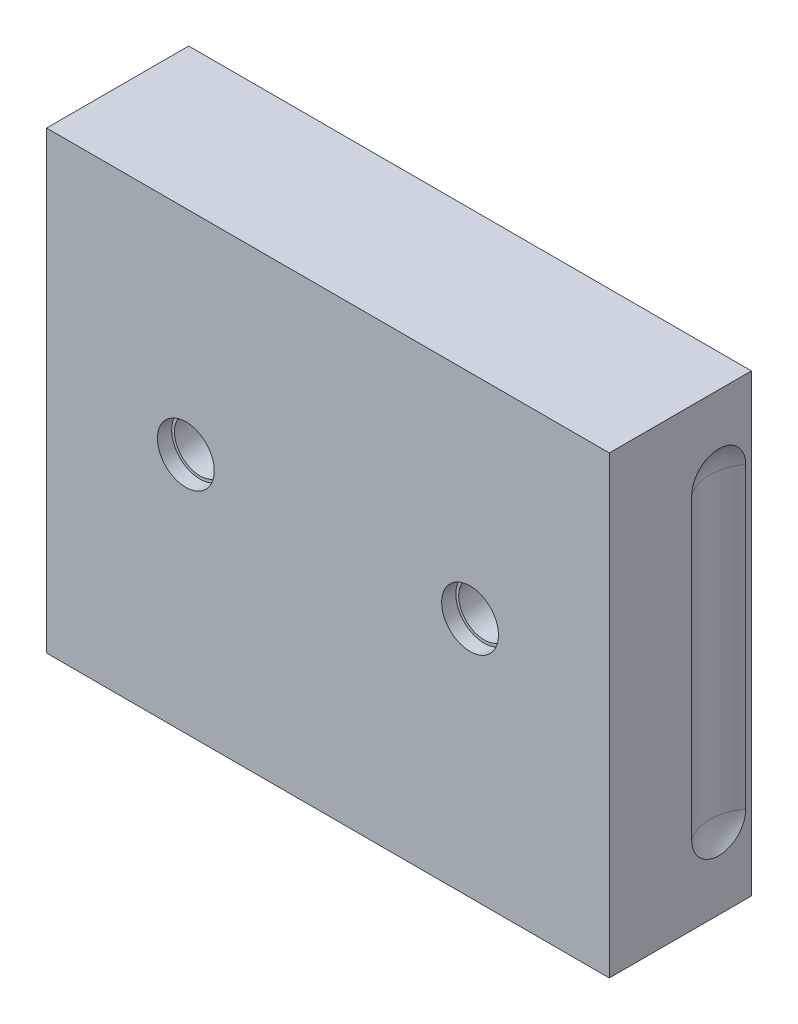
ISO-10303-21;
HEADER;
FILE_DESCRIPTION(('STEP AP214'),'2;1');
FILE_NAME('part.step','',(''),(''),'','','');
FILE_SCHEMA(('AUTOMOTIVE_DESIGN { 1 0 10303 214 1 1 1 1 }'));
ENDSEC;
DATA;
#1=APPLICATION_CONTEXT('core data for automotive mechanical design processes');
#2=APPLICATION_PROTOCOL_DEFINITION('international standard','automotive_design',2000,#1);
#3=PRODUCT_CONTEXT('',#1,'mechanical');
#4=PRODUCT('Part','Part','',(#3));
#5=PRODUCT_RELATED_PRODUCT_CATEGORY('part','',(#4));
#6=PRODUCT_DEFINITION_FORMATION('','',#4);
#7=PRODUCT_DEFINITION_CONTEXT('part definition',#1,'design');
#8=PRODUCT_DEFINITION('design','',#6,#7);
#9=PRODUCT_DEFINITION_SHAPE('','',#8);
#10=(LENGTH_UNIT() NAMED_UNIT(*) SI_UNIT(.MILLI.,.METRE.));
#11=(NAMED_UNIT(*) PLANE_ANGLE_UNIT() SI_UNIT($,.RADIAN.));
#12=(NAMED_UNIT(*) SI_UNIT($,.STERADIAN.) SOLID_ANGLE_UNIT());
#13=UNCERTAINTY_MEASURE_WITH_UNIT(LENGTH_MEASURE(1.E-05),#10,'distance_accuracy_value','');
#14=(GEOMETRIC_REPRESENTATION_CONTEXT(3) GLOBAL_UNCERTAINTY_ASSIGNED_CONTEXT((#13)) GLOBAL_UNIT_ASSIGNED_CONTEXT((#10,
#11,#12)) REPRESENTATION_CONTEXT('',''));
#15=CARTESIAN_POINT('',(0.,0.,0.));
#16=DIRECTION('',(0.,0.,1.));
#17=DIRECTION('',(1.,0.,0.));
#18=AXIS2_PLACEMENT_3D('',#15,#16,#17);
#19=CARTESIAN_POINT('',(-74.5004119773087,196.799588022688,94.5));
#20=DIRECTION('',(0.,0.,-1.));
#21=DIRECTION('',(-1.,0.,0.));
#22=AXIS2_PLACEMENT_3D('',#19,#20,#21);
#23=CYLINDRICAL_SURFACE('',#22,5.);
#24=CARTESIAN_POINT('',(-74.5004119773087,196.799588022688,62.5));
#25=DIRECTION('',(0.,0.,-1.));
#26=DIRECTION('',(-1.,0.,0.));
#27=AXIS2_PLACEMENT_3D('',#24,#25,#26);
#28=CIRCLE('',#27,5.);
#29=CARTESIAN_POINT('',(-79.5004119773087,196.799588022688,62.5));
#30=VERTEX_POINT('',#29);
#31=EDGE_CURVE('E340',#30,#30,#28,.F.);
#32=ORIENTED_EDGE('',*,*,#31,.F.);
#33=EDGE_LOOP('',(#32));
#34=FACE_BOUND('',#33,.T.);
#35=CARTESIAN_POINT('',(-74.5004119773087,196.799588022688,79.5));
#36=DIRECTION('',(0.,0.,-1.));
#37=DIRECTION('',(-1.,0.,0.));
#38=AXIS2_PLACEMENT_3D('',#35,#36,#37);
#39=CIRCLE('',#38,5.);
#40=CARTESIAN_POINT('',(-79.5004119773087,196.799588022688,79.5));
#41=VERTEX_POINT('',#40);
#42=EDGE_CURVE('E18',#41,#41,#39,.F.);
#43=ORIENTED_EDGE('',*,*,#42,.T.);
#44=EDGE_LOOP('',(#43));
#45=FACE_BOUND('',#44,.T.);
#46=ADVANCED_FACE('F14',(#34,#45),#23,.F.);
#47=CARTESIAN_POINT('',(-174.500411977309,196.799588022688,94.5));
#48=DIRECTION('',(0.,0.,-1.));
#49=DIRECTION('',(-1.,0.,0.));
#50=AXIS2_PLACEMENT_3D('',#47,#48,#49);
#51=CYLINDRICAL_SURFACE('',#50,5.);
#52=CARTESIAN_POINT('',(-174.500411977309,196.799588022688,62.5));
#53=DIRECTION('',(0.,0.,-1.));
#54=DIRECTION('',(-1.,0.,0.));
#55=AXIS2_PLACEMENT_3D('',#52,#53,#54);
#56=CIRCLE('',#55,5.);
#57=CARTESIAN_POINT('',(-179.500411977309,196.799588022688,62.5));
#58=VERTEX_POINT('',#57);
#59=EDGE_CURVE('E334',#58,#58,#56,.F.);
#60=ORIENTED_EDGE('',*,*,#59,.F.);
#61=EDGE_LOOP('',(#60));
#62=FACE_BOUND('',#61,.T.);
#63=CARTESIAN_POINT('',(-174.500411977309,196.799588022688,79.5));
#64=DIRECTION('',(0.,0.,-1.));
#65=DIRECTION('',(-1.,0.,0.));
#66=AXIS2_PLACEMENT_3D('',#63,#64,#65);
#67=CIRCLE('',#66,5.);
#68=CARTESIAN_POINT('',(-179.500411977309,196.799588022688,79.5));
#69=VERTEX_POINT('',#68);
#70=EDGE_CURVE('E342',#69,#69,#67,.F.);
#71=ORIENTED_EDGE('',*,*,#70,.T.);
#72=EDGE_LOOP('',(#71));
#73=FACE_BOUND('',#72,.T.);
#74=ADVANCED_FACE('F353',(#62,#73),#51,.F.);
#75=CARTESIAN_POINT('',(-74.5004119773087,196.799588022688,79.5));
#76=DIRECTION('',(0.,0.,-1.));
#77=DIRECTION('',(-1.,0.,0.));
#78=AXIS2_PLACEMENT_3D('',#75,#76,#77);
#79=PLANE('',#78);
#80=CARTESIAN_POINT('',(-74.5004119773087,196.799588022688,79.5));
#81=DIRECTION('',(0.,0.,-1.));
#82=DIRECTION('',(-1.,0.,0.));
#83=AXIS2_PLACEMENT_3D('',#80,#81,#82);
#84=CIRCLE('',#83,9.);
#85=CARTESIAN_POINT('',(-83.5004119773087,196.799588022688,79.5));
#86=VERTEX_POINT('',#85);
#87=EDGE_CURVE('E328',#86,#86,#84,.F.);
#88=ORIENTED_EDGE('',*,*,#87,.T.);
#89=EDGE_LOOP('',(#88));
#90=FACE_BOUND('',#89,.T.);
#91=ORIENTED_EDGE('',*,*,#42,.F.);
#92=EDGE_LOOP('',(#91));
#93=FACE_BOUND('',#92,.T.);
#94=ADVANCED_FACE('F350',(#90,#93),#79,.F.);
#95=CARTESIAN_POINT('',(-174.500411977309,196.799588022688,79.5));
#96=DIRECTION('',(0.,0.,-1.));
#97=DIRECTION('',(-1.,0.,0.));
#98=AXIS2_PLACEMENT_3D('',#95,#96,#97);
#99=PLANE('',#98);
#100=CARTESIAN_POINT('',(-174.500411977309,196.799588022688,79.5));
#101=DIRECTION('',(0.,0.,-1.));
#102=DIRECTION('',(-1.,0.,0.));
#103=AXIS2_PLACEMENT_3D('',#100,#101,#102);
#104=CIRCLE('',#103,9.);
#105=CARTESIAN_POINT('',(-183.500411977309,196.799588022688,79.5));
#106=VERTEX_POINT('',#105);
#107=EDGE_CURVE('E325',#106,#106,#104,.F.);
#108=ORIENTED_EDGE('',*,*,#107,.T.);
#109=EDGE_LOOP('',(#108));
#110=FACE_BOUND('',#109,.T.);
#111=ORIENTED_EDGE('',*,*,#70,.F.);
#112=EDGE_LOOP('',(#111));
#113=FACE_BOUND('',#112,.T.);
#114=ADVANCED_FACE('F352',(#110,#113),#99,.F.);
#115=CARTESIAN_POINT('',(-74.5004119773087,196.799588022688,62.5));
#116=DIRECTION('',(0.,0.,-1.));
#117=DIRECTION('',(-1.,0.,0.));
#118=AXIS2_PLACEMENT_3D('',#115,#116,#117);
#119=PLANE('',#118);
#120=CARTESIAN_POINT('',(-74.5004119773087,196.799588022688,62.5));
#121=DIRECTION('',(0.,0.,1.));
#122=DIRECTION('',(1.,0.,0.));
#123=AXIS2_PLACEMENT_3D('',#120,#121,#122);
#124=CIRCLE('',#123,9.);
#125=CARTESIAN_POINT('',(-65.5004119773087,196.799588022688,62.5));
#126=VERTEX_POINT('',#125);
#127=EDGE_CURVE('E327',#126,#126,#124,.T.);
#128=ORIENTED_EDGE('',*,*,#127,.F.);
#129=EDGE_LOOP('',(#128));
#130=FACE_BOUND('',#129,.T.);
#131=ORIENTED_EDGE('',*,*,#31,.T.);
#132=EDGE_LOOP('',(#131));
#133=FACE_BOUND('',#132,.T.);
#134=ADVANCED_FACE('F361',(#130,#133),#119,.T.);
#135=CARTESIAN_POINT('',(-174.500411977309,196.799588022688,62.5));
#136=DIRECTION('',(0.,0.,-1.));
#137=DIRECTION('',(-1.,0.,0.));
#138=AXIS2_PLACEMENT_3D('',#135,#136,#137);
#139=PLANE('',#138);
#140=CARTESIAN_POINT('',(-174.500411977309,196.799588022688,62.5));
#141=DIRECTION('',(0.,0.,1.));
#142=DIRECTION('',(1.,0.,0.));
#143=AXIS2_PLACEMENT_3D('',#140,#141,#142);
#144=CIRCLE('',#143,9.);
#145=CARTESIAN_POINT('',(-165.500411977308,196.799588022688,62.5));
#146=VERTEX_POINT('',#145);
#147=EDGE_CURVE('E331',#146,#146,#144,.T.);
#148=ORIENTED_EDGE('',*,*,#147,.F.);
#149=EDGE_LOOP('',(#148));
#150=FACE_BOUND('',#149,.T.);
#151=ORIENTED_EDGE('',*,*,#59,.T.);
#152=EDGE_LOOP('',(#151));
#153=FACE_BOUND('',#152,.T.);
#154=ADVANCED_FACE('F369',(#150,#153),#139,.T.);
#155=CARTESIAN_POINT('',(-112.985411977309,221.299588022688,83.));
#156=DIRECTION('',(0.,0.,-1.));
#157=DIRECTION('',(-1.,0.,0.));
#158=AXIS2_PLACEMENT_3D('',#155,#156,#157);
#159=TOROIDAL_SURFACE('',#158,8.99999999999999,2.5);
#160=CARTESIAN_POINT('',(-101.500411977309,221.299588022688,83.2734501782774));
#161=CARTESIAN_POINT('',(-101.500411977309,221.246790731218,83.273455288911));
#162=CARTESIAN_POINT('',(-101.500411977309,221.193966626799,83.2701925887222));
#163=CARTESIAN_POINT('',(-101.500411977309,221.1155257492,83.2600004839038));
#164=CARTESIAN_POINT('',(-101.500411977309,221.089544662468,83.2557291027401));
#165=CARTESIAN_POINT('',(-101.500411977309,221.037960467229,83.2452152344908));
#166=CARTESIAN_POINT('',(-101.500411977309,221.01235748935,83.2389720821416));
#167=CARTESIAN_POINT('',(-101.500411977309,220.967249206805,83.2257832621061));
#168=CARTESIAN_POINT('',(-101.500411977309,220.947615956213,83.2192769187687));
#169=CARTESIAN_POINT('',(-101.500411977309,220.908988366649,83.2046080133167));
#170=CARTESIAN_POINT('',(-101.500411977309,220.889993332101,83.1964473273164));
#171=CARTESIAN_POINT('',(-101.500411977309,220.852778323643,83.1779977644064));
#172=CARTESIAN_POINT('',(-101.500411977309,220.834569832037,83.1676854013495));
#173=CARTESIAN_POINT('',(-101.500411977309,220.799917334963,83.1444367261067));
#174=CARTESIAN_POINT('',(-101.500411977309,220.783465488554,83.1315128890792));
#175=CARTESIAN_POINT('',(-101.500411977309,220.762009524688,83.1103383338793));
#176=CARTESIAN_POINT('',(-101.500411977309,220.755687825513,83.1034297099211));
#177=CARTESIAN_POINT('',(-101.500411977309,220.743956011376,83.0888561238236));
#178=CARTESIAN_POINT('',(-101.500411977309,220.738546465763,83.0811906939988));
#179=CARTESIAN_POINT('',(-101.500411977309,220.72891222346,83.0649921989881));
#180=CARTESIAN_POINT('',(-101.500411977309,220.724704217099,83.0564489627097));
#181=CARTESIAN_POINT('',(-101.500411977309,220.718000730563,83.038730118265));
#182=CARTESIAN_POINT('',(-101.500411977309,220.715498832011,83.0295570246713));
#183=CARTESIAN_POINT('',(-101.500411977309,220.712682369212,83.0118191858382));
#184=CARTESIAN_POINT('',(-101.500411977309,220.712173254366,83.0032859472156));
#185=CARTESIAN_POINT('',(-101.500411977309,220.712864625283,82.9862928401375));
#186=CARTESIAN_POINT('',(-101.500411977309,220.714065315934,82.9778329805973));
#187=CARTESIAN_POINT('',(-101.500411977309,220.719443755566,82.9554528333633));
#188=CARTESIAN_POINT('',(-101.500411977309,220.72512391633,82.9418895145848));
#189=CARTESIAN_POINT('',(-101.500411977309,220.738244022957,82.9189771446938));
#190=CARTESIAN_POINT('',(-101.500411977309,220.745174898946,82.9093104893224));
#191=CARTESIAN_POINT('',(-101.500411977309,220.760442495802,82.8911398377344));
#192=CARTESIAN_POINT('',(-101.500411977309,220.768782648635,82.882638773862));
#193=CARTESIAN_POINT('',(-101.500411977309,220.793090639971,82.860639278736));
#194=CARTESIAN_POINT('',(-101.500411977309,220.81004308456,82.8482454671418));
#195=CARTESIAN_POINT('',(-101.500411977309,220.845496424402,82.8259633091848));
#196=CARTESIAN_POINT('',(-101.500411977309,220.864000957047,82.8160810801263));
#197=CARTESIAN_POINT('',(-101.500411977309,220.902064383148,82.7982439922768));
#198=CARTESIAN_POINT('',(-101.500411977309,220.921629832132,82.790303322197));
#199=CARTESIAN_POINT('',(-101.500411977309,220.96135707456,82.7760830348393));
#200=CARTESIAN_POINT('',(-101.500411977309,220.981519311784,82.7698046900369));
#201=CARTESIAN_POINT('',(-101.500411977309,221.042678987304,82.7530655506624));
#202=CARTESIAN_POINT('',(-101.500411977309,221.084266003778,82.7447364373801));
#203=CARTESIAN_POINT('',(-101.500411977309,221.160393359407,82.7338085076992));
#204=CARTESIAN_POINT('',(-101.500411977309,221.194834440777,82.7304412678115));
#205=CARTESIAN_POINT('',(-101.500411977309,221.263909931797,82.7265736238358));
#206=CARTESIAN_POINT('',(-101.500411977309,221.298544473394,82.7260755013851));
#207=CARTESIAN_POINT('',(-101.500411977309,221.367699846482,82.7279146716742));
#208=CARTESIAN_POINT('',(-101.500411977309,221.402220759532,82.7302489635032));
#209=CARTESIAN_POINT('',(-101.500411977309,221.470911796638,82.7379061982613));
#210=CARTESIAN_POINT('',(-101.500411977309,221.505082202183,82.7432265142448));
#211=CARTESIAN_POINT('',(-101.500411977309,221.571545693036,82.7570160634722));
#212=CARTESIAN_POINT('',(-101.500411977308,221.603862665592,82.7653688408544));
#213=CARTESIAN_POINT('',(-101.50041197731,221.66721060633,82.7859159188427));
#214=CARTESIAN_POINT('',(-101.500411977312,221.698245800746,82.7980962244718));
#215=CARTESIAN_POINT('',(-101.50041197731,221.742251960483,82.8199636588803));
#216=CARTESIAN_POINT('',(-101.500411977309,221.756214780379,82.8276467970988));
#217=CARTESIAN_POINT('',(-101.500411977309,221.783230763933,82.8444560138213));
#218=CARTESIAN_POINT('',(-101.500411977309,221.796285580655,82.8535793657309));
#219=CARTESIAN_POINT('',(-101.500411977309,221.818726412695,82.8717689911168));
#220=CARTESIAN_POINT('',(-101.500411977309,221.828346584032,82.8805400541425));
#221=CARTESIAN_POINT('',(-101.500411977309,221.846135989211,82.8994148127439));
#222=CARTESIAN_POINT('',(-101.500411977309,221.854309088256,82.9095148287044));
#223=CARTESIAN_POINT('',(-101.500411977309,221.870465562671,82.9343470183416));
#224=CARTESIAN_POINT('',(-101.500411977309,221.877751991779,82.949583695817));
#225=CARTESIAN_POINT('',(-101.500411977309,221.884318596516,82.9737193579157));
#226=CARTESIAN_POINT('',(-101.500411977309,221.885775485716,82.9820332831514));
#227=CARTESIAN_POINT('',(-101.500411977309,221.887030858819,82.9987883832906));
#228=CARTESIAN_POINT('',(-101.500411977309,221.886830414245,83.0072294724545));
#229=CARTESIAN_POINT('',(-101.500411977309,221.884928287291,83.0228241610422));
#230=CARTESIAN_POINT('',(-101.500411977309,221.883423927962,83.030003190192));
#231=CARTESIAN_POINT('',(-101.500411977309,221.879313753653,83.0440462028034));
#232=CARTESIAN_POINT('',(-101.500411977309,221.876705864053,83.0509095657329));
#233=CARTESIAN_POINT('',(-101.500411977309,221.864854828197,83.076596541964));
#234=CARTESIAN_POINT('',(-101.500411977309,221.852299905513,83.0938883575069));
#235=CARTESIAN_POINT('',(-101.500411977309,221.825929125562,83.1221499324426));
#236=CARTESIAN_POINT('',(-101.500411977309,221.812649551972,83.1336903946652));
#237=CARTESIAN_POINT('',(-101.500411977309,221.784543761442,83.1547882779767));
#238=CARTESIAN_POINT('',(-101.500411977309,221.769713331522,83.1643400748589));
#239=CARTESIAN_POINT('',(-101.500411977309,221.739332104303,83.1816683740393));
#240=CARTESIAN_POINT('',(-101.500411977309,221.723793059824,83.1894661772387));
#241=CARTESIAN_POINT('',(-101.500411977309,221.692111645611,83.2037344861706));
#242=CARTESIAN_POINT('',(-101.500411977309,221.675968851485,83.2102040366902));
#243=CARTESIAN_POINT('',(-101.500411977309,221.626906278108,83.2279283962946));
#244=CARTESIAN_POINT('',(-101.500411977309,221.593375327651,83.2374868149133));
#245=CARTESIAN_POINT('',(-101.500411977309,221.516915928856,83.2550274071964));
#246=CARTESIAN_POINT('',(-101.500411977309,221.473763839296,83.2619925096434));
#247=CARTESIAN_POINT('',(-101.500411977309,221.386943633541,83.2712043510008));
#248=CARTESIAN_POINT('',(-101.500411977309,221.343275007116,83.2734459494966));
#249=CARTESIAN_POINT('',(-101.500411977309,221.299588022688,83.2734501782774));
#250=B_SPLINE_CURVE_WITH_KNOTS('',3,(#160,#161,#162,#163,#164,#165,#166,#167,#168,#169,#170,
#171,#172,#173,#174,#175,#176,#177,#178,#179,#180,#181,#182,#183,#184,#185,#186,#187,#188,#189,
#190,#191,#192,#193,#194,#195,#196,#197,#198,#199,#200,#201,#202,#203,#204,#205,#206,#207,#208,
#209,#210,#211,#212,#213,#214,#215,#216,#217,#218,#219,#220,#221,#222,#223,#224,#225,#226,#227,
#228,#229,#230,#231,#232,#233,#234,#235,#236,#237,#238,#239,#240,#241,#242,#243,#244,#245,#246,
#247,#248,#249),.UNSPECIFIED.,.T.,.F.,(4,2,2,2,2,2,2,2,2,2,2,2,2,2,2,2,2,2,2,2,2,2,2,2,2,2,2,2,
2,2,2,2,2,2,2,2,2,2,2,2,2,2,2,2,4),(0.,0.15828049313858,0.237215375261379,0.316176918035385,
0.378168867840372,0.44009090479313,0.502727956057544,0.565072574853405,0.593109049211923,
0.621162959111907,0.649589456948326,0.677908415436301,0.703381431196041,0.72885749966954,
0.772301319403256,0.807831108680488,0.843448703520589,0.906101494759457,0.968905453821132,
1.03215550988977,1.0954538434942,1.22232014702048,1.32603071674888,1.42982374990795,
1.53350691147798,1.63709900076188,1.73707341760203,1.83668645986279,1.88443333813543,
1.9320908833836,1.97102529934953,2.00985409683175,2.05957979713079,2.0847548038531,
2.10991353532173,2.13182148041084,2.15377079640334,2.21659974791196,2.26922071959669,
2.3219885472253,2.37407604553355,2.42620087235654,2.53052777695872,2.6613542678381,
2.79232305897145),.UNSPECIFIED.);
#251=CARTESIAN_POINT('',(-101.500411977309,221.299588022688,83.2734501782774));
#252=VERTEX_POINT('',#251);
#253=EDGE_CURVE('E702',#252,#252,#250,.T.);
#254=ORIENTED_EDGE('',*,*,#253,.F.);
#255=EDGE_LOOP('',(#254));
#256=FACE_BOUND('',#255,.T.);
#257=ADVANCED_FACE('F373',(#256),#159,.F.);
#258=CARTESIAN_POINT('',(-112.985411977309,162.299588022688,83.));
#259=DIRECTION('',(0.,0.,-1.));
#260=DIRECTION('',(-1.,0.,0.));
#261=AXIS2_PLACEMENT_3D('',#258,#259,#260);
#262=TOROIDAL_SURFACE('',#261,8.99999999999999,2.5);
#263=CARTESIAN_POINT('',(-101.500411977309,162.299588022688,83.2734501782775));
#264=CARTESIAN_POINT('',(-101.500411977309,162.246790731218,83.2734552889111));
#265=CARTESIAN_POINT('',(-101.500411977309,162.193966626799,83.2701925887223));
#266=CARTESIAN_POINT('',(-101.500411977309,162.1155257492,83.2600004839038));
#267=CARTESIAN_POINT('',(-101.500411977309,162.089544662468,83.2557291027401));
#268=CARTESIAN_POINT('',(-101.500411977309,162.037960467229,83.2452152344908));
#269=CARTESIAN_POINT('',(-101.500411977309,162.01235748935,83.2389720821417));
#270=CARTESIAN_POINT('',(-101.500411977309,161.967249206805,83.2257832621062));
#271=CARTESIAN_POINT('',(-101.500411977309,161.947615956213,83.2192769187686));
#272=CARTESIAN_POINT('',(-101.500411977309,161.908988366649,83.2046080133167));
#273=CARTESIAN_POINT('',(-101.500411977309,161.889993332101,83.1964473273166));
#274=CARTESIAN_POINT('',(-101.500411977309,161.852778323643,83.1779977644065));
#275=CARTESIAN_POINT('',(-101.500411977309,161.834569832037,83.1676854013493));
#276=CARTESIAN_POINT('',(-101.500411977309,161.799917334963,83.1444367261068));
#277=CARTESIAN_POINT('',(-101.50041197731,161.783465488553,83.1315128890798));
#278=CARTESIAN_POINT('',(-101.500411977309,161.762009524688,83.1103383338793));
#279=CARTESIAN_POINT('',(-101.500411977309,161.755687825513,83.1034297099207));
#280=CARTESIAN_POINT('',(-101.500411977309,161.743956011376,83.0888561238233));
#281=CARTESIAN_POINT('',(-101.500411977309,161.738546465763,83.0811906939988));
#282=CARTESIAN_POINT('',(-101.500411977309,161.72891222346,83.0649921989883));
#283=CARTESIAN_POINT('',(-101.500411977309,161.724704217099,83.0564489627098));
#284=CARTESIAN_POINT('',(-101.500411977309,161.718000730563,83.038730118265));
#285=CARTESIAN_POINT('',(-101.500411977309,161.715498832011,83.0295570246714));
#286=CARTESIAN_POINT('',(-101.500411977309,161.712682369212,83.0118191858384));
#287=CARTESIAN_POINT('',(-101.500411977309,161.712173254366,83.0032859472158));
#288=CARTESIAN_POINT('',(-101.500411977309,161.712864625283,82.9862928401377));
#289=CARTESIAN_POINT('',(-101.500411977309,161.714065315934,82.9778329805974));
#290=CARTESIAN_POINT('',(-101.500411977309,161.719443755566,82.9554528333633));
#291=CARTESIAN_POINT('',(-101.500411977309,161.725123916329,82.9418895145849));
#292=CARTESIAN_POINT('',(-101.500411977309,161.738244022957,82.9189771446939));
#293=CARTESIAN_POINT('',(-101.500411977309,161.745174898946,82.9093104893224));
#294=CARTESIAN_POINT('',(-101.500411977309,161.760442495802,82.8911398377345));
#295=CARTESIAN_POINT('',(-101.500411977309,161.768782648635,82.8826387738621));
#296=CARTESIAN_POINT('',(-101.500411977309,161.793090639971,82.8606392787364));
#297=CARTESIAN_POINT('',(-101.500411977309,161.81004308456,82.8482454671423));
#298=CARTESIAN_POINT('',(-101.500411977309,161.845496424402,82.8259633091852));
#299=CARTESIAN_POINT('',(-101.500411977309,161.864000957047,82.8160810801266));
#300=CARTESIAN_POINT('',(-101.500411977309,161.902064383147,82.7982439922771));
#301=CARTESIAN_POINT('',(-101.500411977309,161.921629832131,82.7903033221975));
#302=CARTESIAN_POINT('',(-101.500411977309,161.961357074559,82.7760830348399));
#303=CARTESIAN_POINT('',(-101.500411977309,161.981519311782,82.7698046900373));
#304=CARTESIAN_POINT('',(-101.500411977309,162.042678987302,82.7530655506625));
#305=CARTESIAN_POINT('',(-101.500411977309,162.084266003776,82.7447364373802));
#306=CARTESIAN_POINT('',(-101.500411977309,162.160393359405,82.7338085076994));
#307=CARTESIAN_POINT('',(-101.500411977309,162.194834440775,82.7304412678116));
#308=CARTESIAN_POINT('',(-101.500411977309,162.263909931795,82.7265736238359));
#309=CARTESIAN_POINT('',(-101.500411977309,162.298544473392,82.7260755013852));
#310=CARTESIAN_POINT('',(-101.500411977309,162.36769984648,82.7279146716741));
#311=CARTESIAN_POINT('',(-101.500411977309,162.40222075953,82.730248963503));
#312=CARTESIAN_POINT('',(-101.500411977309,162.470911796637,82.7379061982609));
#313=CARTESIAN_POINT('',(-101.500411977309,162.505082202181,82.7432265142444));
#314=CARTESIAN_POINT('',(-101.500411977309,162.571545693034,82.7570160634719));
#315=CARTESIAN_POINT('',(-101.500411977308,162.60386266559,82.7653688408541));
#316=CARTESIAN_POINT('',(-101.50041197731,162.667210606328,82.7859159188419));
#317=CARTESIAN_POINT('',(-101.500411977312,162.698245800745,82.7980962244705));
#318=CARTESIAN_POINT('',(-101.50041197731,162.742251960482,82.8199636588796));
#319=CARTESIAN_POINT('',(-101.500411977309,162.756214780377,82.8276467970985));
#320=CARTESIAN_POINT('',(-101.500411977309,162.783230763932,82.844456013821));
#321=CARTESIAN_POINT('',(-101.500411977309,162.796285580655,82.85357936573));
#322=CARTESIAN_POINT('',(-101.500411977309,162.818726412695,82.8717689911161));
#323=CARTESIAN_POINT('',(-101.500411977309,162.828346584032,82.8805400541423));
#324=CARTESIAN_POINT('',(-101.500411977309,162.84613598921,82.8994148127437));
#325=CARTESIAN_POINT('',(-101.500411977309,162.854309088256,82.9095148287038));
#326=CARTESIAN_POINT('',(-101.500411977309,162.870465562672,82.9343470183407));
#327=CARTESIAN_POINT('',(-101.500411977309,162.87775199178,82.9495836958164));
#328=CARTESIAN_POINT('',(-101.500411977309,162.884318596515,82.9737193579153));
#329=CARTESIAN_POINT('',(-101.500411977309,162.885775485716,82.9820332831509));
#330=CARTESIAN_POINT('',(-101.500411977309,162.887030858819,82.9987883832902));
#331=CARTESIAN_POINT('',(-101.500411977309,162.886830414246,83.0072294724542));
#332=CARTESIAN_POINT('',(-101.500411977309,162.884928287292,83.0228241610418));
#333=CARTESIAN_POINT('',(-101.500411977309,162.883423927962,83.0300031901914));
#334=CARTESIAN_POINT('',(-101.500411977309,162.879313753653,83.0440462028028));
#335=CARTESIAN_POINT('',(-101.500411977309,162.876705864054,83.0509095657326));
#336=CARTESIAN_POINT('',(-101.500411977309,162.864854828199,83.0765965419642));
#337=CARTESIAN_POINT('',(-101.500411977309,162.852299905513,83.0938883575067));
#338=CARTESIAN_POINT('',(-101.500411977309,162.825929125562,83.1221499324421));
#339=CARTESIAN_POINT('',(-101.500411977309,162.812649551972,83.1336903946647));
#340=CARTESIAN_POINT('',(-101.500411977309,162.784543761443,83.1547882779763));
#341=CARTESIAN_POINT('',(-101.500411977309,162.769713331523,83.1643400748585));
#342=CARTESIAN_POINT('',(-101.500411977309,162.739332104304,83.1816683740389));
#343=CARTESIAN_POINT('',(-101.500411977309,162.723793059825,83.1894661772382));
#344=CARTESIAN_POINT('',(-101.500411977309,162.692111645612,83.20373448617));
#345=CARTESIAN_POINT('',(-101.500411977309,162.675968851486,83.2102040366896));
#346=CARTESIAN_POINT('',(-101.500411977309,162.626906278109,83.227928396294));
#347=CARTESIAN_POINT('',(-101.500411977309,162.593375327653,83.2374868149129));
#348=CARTESIAN_POINT('',(-101.500411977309,162.516915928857,83.2550274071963));
#349=CARTESIAN_POINT('',(-101.500411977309,162.473763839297,83.2619925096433));
#350=CARTESIAN_POINT('',(-101.500411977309,162.386943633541,83.2712043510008));
#351=CARTESIAN_POINT('',(-101.500411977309,162.343275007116,83.2734459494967));
#352=CARTESIAN_POINT('',(-101.500411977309,162.299588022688,83.2734501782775));
#353=B_SPLINE_CURVE_WITH_KNOTS('',3,(#263,#264,#265,#266,#267,#268,#269,#270,#271,#272,#273,
#274,#275,#276,#277,#278,#279,#280,#281,#282,#283,#284,#285,#286,#287,#288,#289,#290,#291,#292,
#293,#294,#295,#296,#297,#298,#299,#300,#301,#302,#303,#304,#305,#306,#307,#308,#309,#310,#311,
#312,#313,#314,#315,#316,#317,#318,#319,#320,#321,#322,#323,#324,#325,#326,#327,#328,#329,#330,
#331,#332,#333,#334,#335,#336,#337,#338,#339,#340,#341,#342,#343,#344,#345,#346,#347,#348,#349,
#350,#351,#352),.UNSPECIFIED.,.T.,.F.,(4,2,2,2,2,2,2,2,2,2,2,2,2,2,2,2,2,2,2,2,2,2,2,2,2,2,2,2,
2,2,2,2,2,2,2,2,2,2,2,2,2,2,2,2,4),(0.,0.158280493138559,0.237215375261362,0.316176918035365,
0.378168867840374,0.440090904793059,0.502727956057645,0.565072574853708,0.593109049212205,
0.621162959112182,0.649589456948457,0.677908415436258,0.703381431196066,0.728857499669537,
0.77230131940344,0.807831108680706,0.843448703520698,0.906101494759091,0.968905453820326,
1.03215550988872,1.0954538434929,1.22232014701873,1.3260307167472,1.42982374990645,
1.53350691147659,1.6370990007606,1.73707341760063,1.83668645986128,1.88443333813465,
1.93209088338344,1.97102529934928,2.00985409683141,2.05957979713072,2.08475480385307,
2.10991353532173,2.13182148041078,2.15377079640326,2.21659974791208,2.26922071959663,
2.32198854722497,2.37407604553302,2.42620087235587,2.53052777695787,2.66135426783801,
2.79232305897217),.UNSPECIFIED.);
#354=CARTESIAN_POINT('',(-101.500411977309,162.299588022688,83.2734501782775));
#355=VERTEX_POINT('',#354);
#356=EDGE_CURVE('E700',#355,#355,#353,.T.);
#357=ORIENTED_EDGE('',*,*,#356,.F.);
#358=EDGE_LOOP('',(#357));
#359=FACE_BOUND('',#358,.T.);
#360=ADVANCED_FACE('F379',(#359),#262,.F.);
#361=CARTESIAN_POINT('',(-136.015411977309,221.299588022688,83.));
#362=DIRECTION('',(0.,0.,-1.));
#363=DIRECTION('',(-1.,0.,0.));
#364=AXIS2_PLACEMENT_3D('',#361,#362,#363);
#365=TOROIDAL_SURFACE('',#364,9.00000000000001,2.5);
#366=CARTESIAN_POINT('',(-147.500411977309,221.299588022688,83.2734501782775));
#367=CARTESIAN_POINT('',(-147.500411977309,221.352385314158,83.2734552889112));
#368=CARTESIAN_POINT('',(-147.500411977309,221.405209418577,83.2701925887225));
#369=CARTESIAN_POINT('',(-147.500411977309,221.483650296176,83.2600004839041));
#370=CARTESIAN_POINT('',(-147.500411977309,221.509631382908,83.2557291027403));
#371=CARTESIAN_POINT('',(-147.500411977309,221.561215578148,83.2452152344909));
#372=CARTESIAN_POINT('',(-147.500411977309,221.586818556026,83.2389720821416));
#373=CARTESIAN_POINT('',(-147.500411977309,221.631926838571,83.2257832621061));
#374=CARTESIAN_POINT('',(-147.500411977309,221.651560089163,83.2192769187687));
#375=CARTESIAN_POINT('',(-147.500411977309,221.690187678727,83.2046080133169));
#376=CARTESIAN_POINT('',(-147.500411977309,221.709182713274,83.1964473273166));
#377=CARTESIAN_POINT('',(-147.500411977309,221.746397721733,83.1779977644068));
#378=CARTESIAN_POINT('',(-147.500411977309,221.764606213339,83.1676854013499));
#379=CARTESIAN_POINT('',(-147.500411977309,221.799258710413,83.1444367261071));
#380=CARTESIAN_POINT('',(-147.500411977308,221.815710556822,83.1315128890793));
#381=CARTESIAN_POINT('',(-147.500411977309,221.837166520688,83.1103383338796));
#382=CARTESIAN_POINT('',(-147.500411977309,221.843488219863,83.1034297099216));
#383=CARTESIAN_POINT('',(-147.500411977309,221.855220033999,83.088856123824));
#384=CARTESIAN_POINT('',(-147.500411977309,221.860629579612,83.081190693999));
#385=CARTESIAN_POINT('',(-147.500411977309,221.870263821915,83.0649921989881));
#386=CARTESIAN_POINT('',(-147.500411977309,221.874471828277,83.0564489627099));
#387=CARTESIAN_POINT('',(-147.500411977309,221.881175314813,83.0387301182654));
#388=CARTESIAN_POINT('',(-147.500411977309,221.883677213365,83.0295570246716));
#389=CARTESIAN_POINT('',(-147.500411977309,221.886493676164,83.0118191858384));
#390=CARTESIAN_POINT('',(-147.500411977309,221.88700279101,83.0032859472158));
#391=CARTESIAN_POINT('',(-147.500411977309,221.886311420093,82.9862928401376));
#392=CARTESIAN_POINT('',(-147.500411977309,221.885110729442,82.9778329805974));
#393=CARTESIAN_POINT('',(-147.500411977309,221.879732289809,82.9554528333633));
#394=CARTESIAN_POINT('',(-147.500411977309,221.874052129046,82.9418895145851));
#395=CARTESIAN_POINT('',(-147.500411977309,221.860932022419,82.9189771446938));
#396=CARTESIAN_POINT('',(-147.500411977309,221.85400114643,82.909310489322));
#397=CARTESIAN_POINT('',(-147.500411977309,221.838733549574,82.8911398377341));
#398=CARTESIAN_POINT('',(-147.500411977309,221.830393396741,82.882638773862));
#399=CARTESIAN_POINT('',(-147.500411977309,221.806085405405,82.8606392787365));
#400=CARTESIAN_POINT('',(-147.500411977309,221.789132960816,82.848245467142));
#401=CARTESIAN_POINT('',(-147.500411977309,221.753679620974,82.8259633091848));
#402=CARTESIAN_POINT('',(-147.500411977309,221.735175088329,82.8160810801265));
#403=CARTESIAN_POINT('',(-147.500411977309,221.697111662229,82.798243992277));
#404=CARTESIAN_POINT('',(-147.500411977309,221.677546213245,82.7903033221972));
#405=CARTESIAN_POINT('',(-147.500411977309,221.637818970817,82.7760830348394));
#406=CARTESIAN_POINT('',(-147.500411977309,221.617656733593,82.7698046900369));
#407=CARTESIAN_POINT('',(-147.500411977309,221.556497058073,82.7530655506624));
#408=CARTESIAN_POINT('',(-147.500411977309,221.514910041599,82.7447364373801));
#409=CARTESIAN_POINT('',(-147.500411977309,221.43878268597,82.7338085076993));
#410=CARTESIAN_POINT('',(-147.500411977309,221.404341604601,82.7304412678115));
#411=CARTESIAN_POINT('',(-147.500411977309,221.335266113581,82.7265736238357));
#412=CARTESIAN_POINT('',(-147.500411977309,221.300631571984,82.7260755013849));
#413=CARTESIAN_POINT('',(-147.500411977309,221.231476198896,82.7279146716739));
#414=CARTESIAN_POINT('',(-147.500411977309,221.196955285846,82.7302489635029));
#415=CARTESIAN_POINT('',(-147.500411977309,221.128264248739,82.7379061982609));
#416=CARTESIAN_POINT('',(-147.500411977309,221.094093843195,82.7432265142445));
#417=CARTESIAN_POINT('',(-147.500411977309,221.027630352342,82.7570160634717));
#418=CARTESIAN_POINT('',(-147.50041197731,220.995313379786,82.7653688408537));
#419=CARTESIAN_POINT('',(-147.500411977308,220.931965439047,82.7859159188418));
#420=CARTESIAN_POINT('',(-147.500411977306,220.900930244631,82.7980962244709));
#421=CARTESIAN_POINT('',(-147.500411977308,220.856924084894,82.8199636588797));
#422=CARTESIAN_POINT('',(-147.500411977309,220.842961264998,82.8276467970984));
#423=CARTESIAN_POINT('',(-147.500411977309,220.815945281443,82.8444560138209));
#424=CARTESIAN_POINT('',(-147.500411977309,220.802890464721,82.8535793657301));
#425=CARTESIAN_POINT('',(-147.500411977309,220.780449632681,82.8717689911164));
#426=CARTESIAN_POINT('',(-147.500411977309,220.770829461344,82.8805400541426));
#427=CARTESIAN_POINT('',(-147.500411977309,220.753040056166,82.899414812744));
#428=CARTESIAN_POINT('',(-147.500411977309,220.74486695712,82.9095148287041));
#429=CARTESIAN_POINT('',(-147.500411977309,220.728710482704,82.9343470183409));
#430=CARTESIAN_POINT('',(-147.500411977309,220.721424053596,82.9495836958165));
#431=CARTESIAN_POINT('',(-147.500411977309,220.71485744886,82.9737193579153));
#432=CARTESIAN_POINT('',(-147.500411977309,220.71340055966,82.9820332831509));
#433=CARTESIAN_POINT('',(-147.500411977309,220.712145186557,82.9987883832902));
#434=CARTESIAN_POINT('',(-147.500411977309,220.71234563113,83.0072294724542));
#435=CARTESIAN_POINT('',(-147.500411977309,220.714247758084,83.0228241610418));
#436=CARTESIAN_POINT('',(-147.500411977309,220.715752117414,83.0300031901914));
#437=CARTESIAN_POINT('',(-147.500411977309,220.719862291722,83.0440462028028));
#438=CARTESIAN_POINT('',(-147.500411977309,220.722470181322,83.0509095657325));
#439=CARTESIAN_POINT('',(-147.500411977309,220.734321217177,83.076596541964));
#440=CARTESIAN_POINT('',(-147.500411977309,220.746876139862,83.0938883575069));
#441=CARTESIAN_POINT('',(-147.500411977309,220.773246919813,83.1221499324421));
#442=CARTESIAN_POINT('',(-147.500411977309,220.786526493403,83.1336903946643));
#443=CARTESIAN_POINT('',(-147.500411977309,220.814632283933,83.1547882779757));
#444=CARTESIAN_POINT('',(-147.500411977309,220.829462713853,83.1643400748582));
#445=CARTESIAN_POINT('',(-147.500411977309,220.859843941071,83.1816683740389));
#446=CARTESIAN_POINT('',(-147.500411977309,220.87538298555,83.1894661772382));
#447=CARTESIAN_POINT('',(-147.500411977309,220.907064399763,83.20373448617));
#448=CARTESIAN_POINT('',(-147.500411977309,220.92320719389,83.2102040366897));
#449=CARTESIAN_POINT('',(-147.500411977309,220.972269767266,83.2279283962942));
#450=CARTESIAN_POINT('',(-147.500411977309,221.005800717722,83.2374868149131));
#451=CARTESIAN_POINT('',(-147.500411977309,221.082260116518,83.2550274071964));
#452=CARTESIAN_POINT('',(-147.500411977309,221.125412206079,83.2619925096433));
#453=CARTESIAN_POINT('',(-147.500411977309,221.212232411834,83.2712043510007));
#454=CARTESIAN_POINT('',(-147.500411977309,221.25590103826,83.2734459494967));
#455=CARTESIAN_POINT('',(-147.500411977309,221.299588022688,83.2734501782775));
#456=B_SPLINE_CURVE_WITH_KNOTS('',3,(#366,#367,#368,#369,#370,#371,#372,#373,#374,#375,#376,
#377,#378,#379,#380,#381,#382,#383,#384,#385,#386,#387,#388,#389,#390,#391,#392,#393,#394,#395,
#396,#397,#398,#399,#400,#401,#402,#403,#404,#405,#406,#407,#408,#409,#410,#411,#412,#413,#414,
#415,#416,#417,#418,#419,#420,#421,#422,#423,#424,#425,#426,#427,#428,#429,#430,#431,#432,#433,
#434,#435,#436,#437,#438,#439,#440,#441,#442,#443,#444,#445,#446,#447,#448,#449,#450,#451,#452,
#453,#454,#455),.UNSPECIFIED.,.T.,.F.,(4,2,2,2,2,2,2,2,2,2,2,2,2,2,2,2,2,2,2,2,2,2,2,2,2,2,2,2,
2,2,2,2,2,2,2,2,2,2,2,2,2,2,2,2,4),(0.,0.158280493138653,0.237215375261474,0.316176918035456,
0.378168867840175,0.440090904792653,0.502727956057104,0.565072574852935,0.593109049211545,
0.62116295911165,0.649589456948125,0.677908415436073,0.70338143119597,0.728857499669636,
0.772301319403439,0.80783110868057,0.843448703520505,0.906101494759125,0.968905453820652,
1.03215550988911,1.09545384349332,1.2223201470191,1.32603071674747,1.42982374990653,
1.53350691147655,1.63709900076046,1.73707341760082,1.83668645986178,1.88443333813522,
1.93209088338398,1.97102529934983,2.00985409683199,2.05957979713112,2.08475480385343,
2.10991353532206,2.13182148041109,2.1537707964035,2.21659974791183,2.26922071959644,
2.32198854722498,2.37407604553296,2.42620087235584,2.53052777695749,2.66135426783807,
2.79232305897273),.UNSPECIFIED.);
#457=CARTESIAN_POINT('',(-147.500411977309,221.299588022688,83.2734501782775));
#458=VERTEX_POINT('',#457);
#459=EDGE_CURVE('E282',#458,#458,#456,.T.);
#460=ORIENTED_EDGE('',*,*,#459,.F.);
#461=EDGE_LOOP('',(#460));
#462=FACE_BOUND('',#461,.T.);
#463=ADVANCED_FACE('F390',(#462),#365,.F.);
#464=CARTESIAN_POINT('',(-136.015411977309,162.299588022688,83.));
#465=DIRECTION('',(0.,0.,-1.));
#466=DIRECTION('',(-1.,0.,0.));
#467=AXIS2_PLACEMENT_3D('',#464,#465,#466);
#468=TOROIDAL_SURFACE('',#467,9.00000000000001,2.5);
#469=CARTESIAN_POINT('',(-147.500411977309,162.299588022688,83.2734501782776));
#470=CARTESIAN_POINT('',(-147.500411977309,162.352385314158,83.2734552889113));
#471=CARTESIAN_POINT('',(-147.500411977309,162.405209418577,83.2701925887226));
#472=CARTESIAN_POINT('',(-147.500411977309,162.483650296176,83.260000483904));
#473=CARTESIAN_POINT('',(-147.500411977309,162.509631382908,83.2557291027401));
#474=CARTESIAN_POINT('',(-147.500411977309,162.561215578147,83.2452152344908));
#475=CARTESIAN_POINT('',(-147.500411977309,162.586818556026,83.2389720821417));
#476=CARTESIAN_POINT('',(-147.500411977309,162.631926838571,83.2257832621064));
#477=CARTESIAN_POINT('',(-147.500411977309,162.651560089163,83.2192769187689));
#478=CARTESIAN_POINT('',(-147.500411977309,162.690187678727,83.2046080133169));
#479=CARTESIAN_POINT('',(-147.500411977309,162.709182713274,83.1964473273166));
#480=CARTESIAN_POINT('',(-147.500411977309,162.746397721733,83.1779977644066));
#481=CARTESIAN_POINT('',(-147.500411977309,162.764606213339,83.1676854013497));
#482=CARTESIAN_POINT('',(-147.500411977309,162.799258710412,83.1444367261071));
#483=CARTESIAN_POINT('',(-147.500411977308,162.815710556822,83.1315128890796));
#484=CARTESIAN_POINT('',(-147.500411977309,162.837166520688,83.1103383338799));
#485=CARTESIAN_POINT('',(-147.500411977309,162.843488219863,83.1034297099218));
#486=CARTESIAN_POINT('',(-147.500411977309,162.855220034,83.0888561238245));
#487=CARTESIAN_POINT('',(-147.500411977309,162.860629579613,83.0811906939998));
#488=CARTESIAN_POINT('',(-147.500411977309,162.870263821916,83.0649921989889));
#489=CARTESIAN_POINT('',(-147.500411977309,162.874471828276,83.0564489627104));
#490=CARTESIAN_POINT('',(-147.500411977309,162.881175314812,83.0387301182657));
#491=CARTESIAN_POINT('',(-147.500411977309,162.883677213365,83.0295570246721));
#492=CARTESIAN_POINT('',(-147.500411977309,162.886493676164,83.0118191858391));
#493=CARTESIAN_POINT('',(-147.500411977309,162.88700279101,83.0032859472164));
#494=CARTESIAN_POINT('',(-147.500411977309,162.886311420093,82.9862928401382));
#495=CARTESIAN_POINT('',(-147.500411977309,162.885110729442,82.977832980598));
#496=CARTESIAN_POINT('',(-147.500411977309,162.87973228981,82.9554528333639));
#497=CARTESIAN_POINT('',(-147.500411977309,162.874052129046,82.9418895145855));
#498=CARTESIAN_POINT('',(-147.500411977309,162.860932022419,82.9189771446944));
#499=CARTESIAN_POINT('',(-147.500411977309,162.85400114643,82.9093104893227));
#500=CARTESIAN_POINT('',(-147.500411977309,162.838733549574,82.8911398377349));
#501=CARTESIAN_POINT('',(-147.500411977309,162.830393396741,82.8826387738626));
#502=CARTESIAN_POINT('',(-147.500411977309,162.806085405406,82.8606392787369));
#503=CARTESIAN_POINT('',(-147.500411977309,162.789132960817,82.8482454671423));
#504=CARTESIAN_POINT('',(-147.500411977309,162.753679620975,82.8259633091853));
#505=CARTESIAN_POINT('',(-147.500411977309,162.73517508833,82.8160810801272));
#506=CARTESIAN_POINT('',(-147.500411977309,162.69711166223,82.7982439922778));
#507=CARTESIAN_POINT('',(-147.500411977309,162.677546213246,82.7903033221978));
#508=CARTESIAN_POINT('',(-147.500411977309,162.637818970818,82.7760830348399));
#509=CARTESIAN_POINT('',(-147.500411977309,162.617656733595,82.7698046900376));
#510=CARTESIAN_POINT('',(-147.500411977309,162.556497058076,82.7530655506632));
#511=CARTESIAN_POINT('',(-147.500411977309,162.514910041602,82.7447364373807));
#512=CARTESIAN_POINT('',(-147.500411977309,162.438782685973,82.7338085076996));
#513=CARTESIAN_POINT('',(-147.500411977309,162.404341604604,82.7304412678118));
#514=CARTESIAN_POINT('',(-147.500411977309,162.335266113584,82.7265736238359));
#515=CARTESIAN_POINT('',(-147.500411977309,162.300631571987,82.726075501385));
#516=CARTESIAN_POINT('',(-147.500411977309,162.231476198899,82.7279146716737));
#517=CARTESIAN_POINT('',(-147.500411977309,162.196955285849,82.7302489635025));
#518=CARTESIAN_POINT('',(-147.500411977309,162.128264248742,82.7379061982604));
#519=CARTESIAN_POINT('',(-147.500411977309,162.094093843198,82.743226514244));
#520=CARTESIAN_POINT('',(-147.500411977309,162.027630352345,82.7570160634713));
#521=CARTESIAN_POINT('',(-147.50041197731,161.995313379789,82.7653688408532));
#522=CARTESIAN_POINT('',(-147.500411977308,161.93196543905,82.7859159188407));
#523=CARTESIAN_POINT('',(-147.500411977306,161.900930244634,82.7980962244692));
#524=CARTESIAN_POINT('',(-147.500411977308,161.856924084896,82.8199636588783));
#525=CARTESIAN_POINT('',(-147.500411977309,161.842961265,82.8276467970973));
#526=CARTESIAN_POINT('',(-147.500411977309,161.815945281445,82.84445601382));
#527=CARTESIAN_POINT('',(-147.500411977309,161.802890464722,82.8535793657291));
#528=CARTESIAN_POINT('',(-147.500411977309,161.780449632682,82.8717689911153));
#529=CARTESIAN_POINT('',(-147.500411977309,161.770829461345,82.8805400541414));
#530=CARTESIAN_POINT('',(-147.500411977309,161.753040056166,82.8994148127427));
#531=CARTESIAN_POINT('',(-147.500411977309,161.74486695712,82.9095148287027));
#532=CARTESIAN_POINT('',(-147.500411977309,161.728710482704,82.9343470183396));
#533=CARTESIAN_POINT('',(-147.500411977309,161.721424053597,82.9495836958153));
#534=CARTESIAN_POINT('',(-147.500411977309,161.71485744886,82.9737193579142));
#535=CARTESIAN_POINT('',(-147.500411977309,161.71340055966,82.9820332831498));
#536=CARTESIAN_POINT('',(-147.500411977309,161.712145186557,82.9987883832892));
#537=CARTESIAN_POINT('',(-147.500411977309,161.712345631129,83.0072294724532));
#538=CARTESIAN_POINT('',(-147.500411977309,161.714247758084,83.0228241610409));
#539=CARTESIAN_POINT('',(-147.500411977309,161.715752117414,83.0300031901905));
#540=CARTESIAN_POINT('',(-147.500411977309,161.719862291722,83.044046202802));
#541=CARTESIAN_POINT('',(-147.500411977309,161.722470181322,83.0509095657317));
#542=CARTESIAN_POINT('',(-147.500411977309,161.734321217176,83.0765965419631));
#543=CARTESIAN_POINT('',(-147.500411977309,161.746876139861,83.0938883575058));
#544=CARTESIAN_POINT('',(-147.500411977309,161.773246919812,83.1221499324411));
#545=CARTESIAN_POINT('',(-147.500411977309,161.786526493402,83.1336903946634));
#546=CARTESIAN_POINT('',(-147.500411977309,161.814632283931,83.1547882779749));
#547=CARTESIAN_POINT('',(-147.500411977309,161.829462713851,83.1643400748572));
#548=CARTESIAN_POINT('',(-147.500411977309,161.859843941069,83.1816683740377));
#549=CARTESIAN_POINT('',(-147.500411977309,161.875382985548,83.189466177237));
#550=CARTESIAN_POINT('',(-147.500411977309,161.90706439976,83.2037344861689));
#551=CARTESIAN_POINT('',(-147.500411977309,161.923207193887,83.2102040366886));
#552=CARTESIAN_POINT('',(-147.500411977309,161.972269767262,83.2279283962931));
#553=CARTESIAN_POINT('',(-147.500411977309,162.005800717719,83.2374868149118));
#554=CARTESIAN_POINT('',(-147.500411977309,162.082260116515,83.2550274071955));
#555=CARTESIAN_POINT('',(-147.500411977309,162.125412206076,83.261992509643));
#556=CARTESIAN_POINT('',(-147.500411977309,162.212232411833,83.2712043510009));
#557=CARTESIAN_POINT('',(-147.500411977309,162.255901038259,83.2734459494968));
#558=CARTESIAN_POINT('',(-147.500411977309,162.299588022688,83.2734501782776));
#559=B_SPLINE_CURVE_WITH_KNOTS('',3,(#469,#470,#471,#472,#473,#474,#475,#476,#477,#478,#479,
#480,#481,#482,#483,#484,#485,#486,#487,#488,#489,#490,#491,#492,#493,#494,#495,#496,#497,#498,
#499,#500,#501,#502,#503,#504,#505,#506,#507,#508,#509,#510,#511,#512,#513,#514,#515,#516,#517,
#518,#519,#520,#521,#522,#523,#524,#525,#526,#527,#528,#529,#530,#531,#532,#533,#534,#535,#536,
#537,#538,#539,#540,#541,#542,#543,#544,#545,#546,#547,#548,#549,#550,#551,#552,#553,#554,#555,
#556,#557,#558),.UNSPECIFIED.,.T.,.F.,(4,2,2,2,2,2,2,2,2,2,2,2,2,2,2,2,2,2,2,2,2,2,2,2,2,2,2,2,
2,2,2,2,2,2,2,2,2,2,2,2,2,2,2,2,4),(0.,0.158280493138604,0.237215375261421,0.316176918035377,
0.378168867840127,0.440090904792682,0.502727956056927,0.565072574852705,0.593109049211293,
0.621162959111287,0.649589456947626,0.677908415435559,0.703381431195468,0.728857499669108,
0.772301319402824,0.807831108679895,0.843448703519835,0.906101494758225,0.968905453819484,
1.03215550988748,1.0954538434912,1.22232014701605,1.32603071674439,1.42982374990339,
1.53350691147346,1.63709900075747,1.73707341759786,1.83668645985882,1.88443333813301,
1.93209088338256,1.9710252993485,2.00985409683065,2.05957979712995,2.08475480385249,
2.10991353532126,2.13182148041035,2.15377079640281,2.21659974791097,2.26922071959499,
2.32198854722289,2.37407604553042,2.42620087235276,2.53052777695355,2.66135426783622,
2.79232305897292),.UNSPECIFIED.);
#560=CARTESIAN_POINT('',(-147.500411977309,162.299588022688,83.2734501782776));
#561=VERTEX_POINT('',#560);
#562=EDGE_CURVE('E273',#561,#561,#559,.T.);
#563=ORIENTED_EDGE('',*,*,#562,.F.);
#564=EDGE_LOOP('',(#563));
#565=FACE_BOUND('',#564,.T.);
#566=ADVANCED_FACE('F288',(#565),#468,.F.);
#567=CARTESIAN_POINT('',(-124.500411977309,191.799588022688,85.5));
#568=DIRECTION('',(0.,0.,-1.));
#569=DIRECTION('',(-1.,0.,0.));
#570=AXIS2_PLACEMENT_3D('',#567,#568,#569);
#571=PLANE('',#570);
#572=DIRECTION('',(0.,1.,0.));
#573=VECTOR('',#572,1.);
#574=CARTESIAN_POINT('',(-147.500411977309,191.799588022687,85.5));
#575=LINE('',#574,#573);
#576=CARTESIAN_POINT('',(-147.500411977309,238.799588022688,85.5));
#577=VERTEX_POINT('',#576);
#578=CARTESIAN_POINT('',(-147.500411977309,144.799588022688,85.5));
#579=VERTEX_POINT('',#578);
#580=EDGE_CURVE('E281',#577,#579,#575,.F.);
#581=ORIENTED_EDGE('',*,*,#580,.F.);
#582=DIRECTION('',(1.,0.,0.));
#583=VECTOR('',#582,1.);
#584=CARTESIAN_POINT('',(-124.500411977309,238.799588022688,85.5));
#585=LINE('',#584,#583);
#586=CARTESIAN_POINT('',(-101.500411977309,238.799588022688,85.5));
#587=VERTEX_POINT('',#586);
#588=EDGE_CURVE('E423',#587,#577,#585,.F.);
#589=ORIENTED_EDGE('',*,*,#588,.F.);
#590=DIRECTION('',(0.,1.,0.));
#591=VECTOR('',#590,1.);
#592=CARTESIAN_POINT('',(-101.500411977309,191.799588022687,85.5));
#593=LINE('',#592,#591);
#594=CARTESIAN_POINT('',(-101.500411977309,144.799588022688,85.5));
#595=VERTEX_POINT('',#594);
#596=EDGE_CURVE('E414',#595,#587,#593,.T.);
#597=ORIENTED_EDGE('',*,*,#596,.F.);
#598=DIRECTION('',(1.,0.,0.));
#599=VECTOR('',#598,1.);
#600=CARTESIAN_POINT('',(-124.500411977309,144.799588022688,85.5));
#601=LINE('',#600,#599);
#602=EDGE_CURVE('E407',#579,#595,#601,.T.);
#603=ORIENTED_EDGE('',*,*,#602,.F.);
#604=EDGE_LOOP('',(#581,#589,#597,#603));
#605=FACE_BOUND('',#604,.T.);
#606=ADVANCED_FACE('F399',(#605),#571,.T.);
#607=CARTESIAN_POINT('',(-74.5004119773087,196.799588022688,99.5));
#608=DIRECTION('',(0.,0.,-1.));
#609=DIRECTION('',(-1.,0.,0.));
#610=AXIS2_PLACEMENT_3D('',#607,#608,#609);
#611=CYLINDRICAL_SURFACE('',#610,9.);
#612=CARTESIAN_POINT('',(-74.5004119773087,196.799588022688,114.5));
#613=DIRECTION('',(0.,0.,-1.));
#614=DIRECTION('',(-1.,0.,0.));
#615=AXIS2_PLACEMENT_3D('',#612,#613,#614);
#616=CIRCLE('',#615,9.);
#617=CARTESIAN_POINT('',(-83.5004119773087,196.799588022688,114.5));
#618=VERTEX_POINT('',#617);
#619=EDGE_CURVE('E269',#618,#618,#616,.F.);
#620=ORIENTED_EDGE('',*,*,#619,.T.);
#621=EDGE_LOOP('',(#620));
#622=FACE_BOUND('',#621,.T.);
#623=ORIENTED_EDGE('',*,*,#87,.F.);
#624=EDGE_LOOP('',(#623));
#625=FACE_BOUND('',#624,.T.);
#626=ADVANCED_FACE('F321',(#622,#625),#611,.F.);
#627=CARTESIAN_POINT('',(-174.500411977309,196.799588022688,99.5));
#628=DIRECTION('',(0.,0.,-1.));
#629=DIRECTION('',(-1.,0.,0.));
#630=AXIS2_PLACEMENT_3D('',#627,#628,#629);
#631=CYLINDRICAL_SURFACE('',#630,9.);
#632=CARTESIAN_POINT('',(-174.500411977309,196.799588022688,114.5));
#633=DIRECTION('',(0.,0.,-1.));
#634=DIRECTION('',(-1.,0.,0.));
#635=AXIS2_PLACEMENT_3D('',#632,#633,#634);
#636=CIRCLE('',#635,9.);
#637=CARTESIAN_POINT('',(-183.500411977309,196.799588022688,114.5));
#638=VERTEX_POINT('',#637);
#639=EDGE_CURVE('E81',#638,#638,#636,.F.);
#640=ORIENTED_EDGE('',*,*,#639,.T.);
#641=EDGE_LOOP('',(#640));
#642=FACE_BOUND('',#641,.T.);
#643=ORIENTED_EDGE('',*,*,#107,.F.);
#644=EDGE_LOOP('',(#643));
#645=FACE_BOUND('',#644,.T.);
#646=ADVANCED_FACE('F317',(#642,#645),#631,.F.);
#647=CARTESIAN_POINT('',(-74.5004119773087,196.799588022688,66.));
#648=DIRECTION('',(0.,0.,1.));
#649=DIRECTION('',(1.,0.,0.));
#650=AXIS2_PLACEMENT_3D('',#647,#648,#649);
#651=CYLINDRICAL_SURFACE('',#650,9.);
#652=ORIENTED_EDGE('',*,*,#127,.T.);
#653=EDGE_LOOP('',(#652));
#654=FACE_BOUND('',#653,.T.);
#655=CARTESIAN_POINT('',(-74.5004119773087,196.799588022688,69.5));
#656=DIRECTION('',(0.,0.,1.));
#657=DIRECTION('',(1.,0.,0.));
#658=AXIS2_PLACEMENT_3D('',#655,#656,#657);
#659=CIRCLE('',#658,9.);
#660=CARTESIAN_POINT('',(-65.5004119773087,196.799588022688,69.5));
#661=VERTEX_POINT('',#660);
#662=EDGE_CURVE('E259',#661,#661,#659,.F.);
#663=ORIENTED_EDGE('',*,*,#662,.T.);
#664=EDGE_LOOP('',(#663));
#665=FACE_BOUND('',#664,.T.);
#666=ADVANCED_FACE('F320',(#654,#665),#651,.T.);
#667=CARTESIAN_POINT('',(-174.500411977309,196.799588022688,66.));
#668=DIRECTION('',(0.,0.,1.));
#669=DIRECTION('',(1.,0.,0.));
#670=AXIS2_PLACEMENT_3D('',#667,#668,#669);
#671=CYLINDRICAL_SURFACE('',#670,9.);
#672=ORIENTED_EDGE('',*,*,#147,.T.);
#673=EDGE_LOOP('',(#672));
#674=FACE_BOUND('',#673,.T.);
#675=CARTESIAN_POINT('',(-174.500411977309,196.799588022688,69.5));
#676=DIRECTION('',(0.,0.,1.));
#677=DIRECTION('',(1.,0.,0.));
#678=AXIS2_PLACEMENT_3D('',#675,#676,#677);
#679=CIRCLE('',#678,9.);
#680=CARTESIAN_POINT('',(-165.500411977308,196.799588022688,69.5));
#681=VERTEX_POINT('',#680);
#682=EDGE_CURVE('E236',#681,#681,#679,.F.);
#683=ORIENTED_EDGE('',*,*,#682,.T.);
#684=EDGE_LOOP('',(#683));
#685=FACE_BOUND('',#684,.T.);
#686=ADVANCED_FACE('F619',(#674,#685),#671,.T.);
#687=CARTESIAN_POINT('',(-101.500411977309,191.799588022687,77.5));
#688=DIRECTION('',(-1.,0.,0.));
#689=DIRECTION('',(0.,0.,1.));
#690=AXIS2_PLACEMENT_3D('',#687,#688,#689);
#691=PLANE('',#690);
#692=DIRECTION('',(0.,0.,-1.));
#693=VECTOR('',#692,1.);
#694=CARTESIAN_POINT('',(-101.500411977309,238.799588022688,69.6));
#695=LINE('',#694,#693);
#696=CARTESIAN_POINT('',(-101.500411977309,238.799588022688,69.5));
#697=VERTEX_POINT('',#696);
#698=EDGE_CURVE('E419',#697,#587,#695,.F.);
#699=ORIENTED_EDGE('',*,*,#698,.F.);
#700=DIRECTION('',(0.,-1.,0.));
#701=VECTOR('',#700,1.);
#702=CARTESIAN_POINT('',(-101.500411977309,191.799588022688,69.5));
#703=LINE('',#702,#701);
#704=CARTESIAN_POINT('',(-101.500411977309,144.799588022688,69.5));
#705=VERTEX_POINT('',#704);
#706=EDGE_CURVE('E232',#697,#705,#703,.T.);
#707=ORIENTED_EDGE('',*,*,#706,.T.);
#708=DIRECTION('',(0.,0.,1.));
#709=VECTOR('',#708,1.);
#710=CARTESIAN_POINT('',(-101.500411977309,144.799588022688,69.6));
#711=LINE('',#710,#709);
#712=EDGE_CURVE('E405',#595,#705,#711,.F.);
#713=ORIENTED_EDGE('',*,*,#712,.F.);
#714=ORIENTED_EDGE('',*,*,#596,.T.);
#715=EDGE_LOOP('',(#699,#707,#713,#714));
#716=FACE_BOUND('',#715,.T.);
#717=ORIENTED_EDGE('',*,*,#356,.T.);
#718=EDGE_LOOP('',(#717));
#719=FACE_BOUND('',#718,.T.);
#720=ORIENTED_EDGE('',*,*,#253,.T.);
#721=EDGE_LOOP('',(#720));
#722=FACE_BOUND('',#721,.T.);
#723=ADVANCED_FACE('F435',(#716,#719,#722),#691,.T.);
#724=CARTESIAN_POINT('',(-124.500411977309,144.799588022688,69.6));
#725=DIRECTION('',(0.,1.,0.));
#726=DIRECTION('',(0.,0.,1.));
#727=AXIS2_PLACEMENT_3D('',#724,#725,#726);
#728=PLANE('',#727);
#729=ORIENTED_EDGE('',*,*,#602,.T.);
#730=ORIENTED_EDGE('',*,*,#712,.T.);
#731=DIRECTION('',(1.,0.,0.));
#732=VECTOR('',#731,1.);
#733=CARTESIAN_POINT('',(-124.500411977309,144.799588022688,69.5));
#734=LINE('',#733,#732);
#735=CARTESIAN_POINT('',(-147.500411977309,144.799588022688,69.5));
#736=VERTEX_POINT('',#735);
#737=EDGE_CURVE('E235',#705,#736,#734,.F.);
#738=ORIENTED_EDGE('',*,*,#737,.T.);
#739=DIRECTION('',(0.,0.,-1.));
#740=VECTOR('',#739,1.);
#741=CARTESIAN_POINT('',(-147.500411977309,144.799588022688,77.5));
#742=LINE('',#741,#740);
#743=EDGE_CURVE('E417',#579,#736,#742,.T.);
#744=ORIENTED_EDGE('',*,*,#743,.F.);
#745=EDGE_LOOP('',(#729,#730,#738,#744));
#746=FACE_BOUND('',#745,.T.);
#747=ADVANCED_FACE('F298',(#746),#728,.T.);
#748=CARTESIAN_POINT('',(-147.500411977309,191.799588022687,77.5));
#749=DIRECTION('',(1.,0.,0.));
#750=DIRECTION('',(0.,0.,-1.));
#751=AXIS2_PLACEMENT_3D('',#748,#749,#750);
#752=PLANE('',#751);
#753=ORIENTED_EDGE('',*,*,#743,.T.);
#754=DIRECTION('',(0.,-1.,0.));
#755=VECTOR('',#754,1.);
#756=CARTESIAN_POINT('',(-147.500411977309,191.799588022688,69.5));
#757=LINE('',#756,#755);
#758=CARTESIAN_POINT('',(-147.500411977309,238.799588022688,69.5));
#759=VERTEX_POINT('',#758);
#760=EDGE_CURVE('E238',#736,#759,#757,.F.);
#761=ORIENTED_EDGE('',*,*,#760,.T.);
#762=DIRECTION('',(0.,0.,-1.));
#763=VECTOR('',#762,1.);
#764=CARTESIAN_POINT('',(-147.500411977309,238.799588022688,69.6));
#765=LINE('',#764,#763);
#766=EDGE_CURVE('E272',#577,#759,#765,.T.);
#767=ORIENTED_EDGE('',*,*,#766,.F.);
#768=ORIENTED_EDGE('',*,*,#580,.T.);
#769=EDGE_LOOP('',(#753,#761,#767,#768));
#770=FACE_BOUND('',#769,.T.);
#771=ORIENTED_EDGE('',*,*,#562,.T.);
#772=EDGE_LOOP('',(#771));
#773=FACE_BOUND('',#772,.T.);
#774=ORIENTED_EDGE('',*,*,#459,.T.);
#775=EDGE_LOOP('',(#774));
#776=FACE_BOUND('',#775,.T.);
#777=ADVANCED_FACE('F292',(#770,#773,#776),#752,.T.);
#778=CARTESIAN_POINT('',(-124.500411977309,238.799588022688,69.6));
#779=DIRECTION('',(0.,-1.,0.));
#780=DIRECTION('',(0.,0.,-1.));
#781=AXIS2_PLACEMENT_3D('',#778,#779,#780);
#782=PLANE('',#781);
#783=ORIENTED_EDGE('',*,*,#588,.T.);
#784=ORIENTED_EDGE('',*,*,#766,.T.);
#785=DIRECTION('',(1.,0.,0.));
#786=VECTOR('',#785,1.);
#787=CARTESIAN_POINT('',(-124.500411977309,238.799588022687,69.5));
#788=LINE('',#787,#786);
#789=EDGE_CURVE('E163',#759,#697,#788,.T.);
#790=ORIENTED_EDGE('',*,*,#789,.T.);
#791=ORIENTED_EDGE('',*,*,#698,.T.);
#792=EDGE_LOOP('',(#783,#784,#790,#791));
#793=FACE_BOUND('',#792,.T.);
#794=ADVANCED_FACE('F297',(#793),#782,.T.);
#795=CARTESIAN_POINT('',(-74.5004119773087,196.799588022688,114.5));
#796=DIRECTION('',(0.,0.,-1.));
#797=DIRECTION('',(-1.,0.,0.));
#798=AXIS2_PLACEMENT_3D('',#795,#796,#797);
#799=PLANE('',#798);
#800=ORIENTED_EDGE('',*,*,#619,.F.);
#801=EDGE_LOOP('',(#800));
#802=FACE_BOUND('',#801,.T.);
#803=CARTESIAN_POINT('',(-74.5004119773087,196.799588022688,114.5));
#804=DIRECTION('',(0.,0.,-1.));
#805=DIRECTION('',(-1.,0.,0.));
#806=AXIS2_PLACEMENT_3D('',#803,#804,#805);
#807=CIRCLE('',#806,10.);
#808=CARTESIAN_POINT('',(-84.5004119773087,196.799588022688,114.5));
#809=VERTEX_POINT('',#808);
#810=EDGE_CURVE('E246',#809,#809,#807,.F.);
#811=ORIENTED_EDGE('',*,*,#810,.T.);
#812=EDGE_LOOP('',(#811));
#813=FACE_BOUND('',#812,.T.);
#814=ADVANCED_FACE('F303',(#802,#813),#799,.F.);
#815=CARTESIAN_POINT('',(-174.500411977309,196.799588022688,114.5));
#816=DIRECTION('',(0.,0.,-1.));
#817=DIRECTION('',(-1.,0.,0.));
#818=AXIS2_PLACEMENT_3D('',#815,#816,#817);
#819=PLANE('',#818);
#820=ORIENTED_EDGE('',*,*,#639,.F.);
#821=EDGE_LOOP('',(#820));
#822=FACE_BOUND('',#821,.T.);
#823=CARTESIAN_POINT('',(-174.500411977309,196.799588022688,114.5));
#824=DIRECTION('',(0.,0.,-1.));
#825=DIRECTION('',(-1.,0.,0.));
#826=AXIS2_PLACEMENT_3D('',#823,#824,#825);
#827=CIRCLE('',#826,10.);
#828=CARTESIAN_POINT('',(-184.500411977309,196.799588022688,114.5));
#829=VERTEX_POINT('',#828);
#830=EDGE_CURVE('E111',#829,#829,#827,.F.);
#831=ORIENTED_EDGE('',*,*,#830,.T.);
#832=EDGE_LOOP('',(#831));
#833=FACE_BOUND('',#832,.T.);
#834=ADVANCED_FACE('F305',(#822,#833),#819,.F.);
#835=CARTESIAN_POINT('',(-12.750411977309,139.299456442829,81.));
#836=DIRECTION('',(0.581584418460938,0.730594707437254,0.357758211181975));
#837=DIRECTION('',(-0.730492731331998,0.662557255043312,-0.16552417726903));
#838=AXIS2_PLACEMENT_3D('',#835,#836,#837);
#839=SPHERICAL_SURFACE('',#838,15.9);
#840=CARTESIAN_POINT('',(-12.750411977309,139.299456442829,81.));
#841=DIRECTION('',(0.,1.,0.));
#842=DIRECTION('',(0.,0.,1.));
#843=AXIS2_PLACEMENT_3D('',#840,#841,#842);
#844=CIRCLE('',#843,15.9);
#845=CARTESIAN_POINT('',(-25.5004119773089,139.299456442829,71.5001315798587));
#846=VERTEX_POINT('',#845);
#847=CARTESIAN_POINT('',(-25.5004119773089,139.299456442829,90.4998684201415));
#848=VERTEX_POINT('',#847);
#849=EDGE_CURVE('E75',#846,#848,#844,.T.);
#850=ORIENTED_EDGE('',*,*,#849,.T.);
#851=CARTESIAN_POINT('',(-25.5004119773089,139.299456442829,90.4998684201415));
#852=CARTESIAN_POINT('',(-25.5004119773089,139.032269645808,90.4998971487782));
#853=CARTESIAN_POINT('',(-25.5004119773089,138.765086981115,90.4885975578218));
#854=CARTESIAN_POINT('',(-25.5004119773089,138.232633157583,90.4435492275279));
#855=CARTESIAN_POINT('',(-25.5004119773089,137.967361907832,90.4098015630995));
#856=CARTESIAN_POINT('',(-25.5004119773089,137.44079333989,90.3200960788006));
#857=CARTESIAN_POINT('',(-25.5004119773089,137.179493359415,90.2641538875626));
#858=CARTESIAN_POINT('',(-25.5004119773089,136.662535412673,90.1304663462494));
#859=CARTESIAN_POINT('',(-25.5004119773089,136.406877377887,90.0527212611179));
#860=CARTESIAN_POINT('',(-25.5004119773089,135.902900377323,89.8759367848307));
#861=CARTESIAN_POINT('',(-25.5004119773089,135.654584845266,89.7768876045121));
#862=CARTESIAN_POINT('',(-25.5004119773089,135.167176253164,89.5582186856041));
#863=CARTESIAN_POINT('',(-25.5004119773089,134.928083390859,89.4385985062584));
#864=CARTESIAN_POINT('',(-25.5004119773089,134.460873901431,89.1796660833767));
#865=CARTESIAN_POINT('',(-25.5004119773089,134.232755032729,89.0403578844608));
#866=CARTESIAN_POINT('',(-25.5004119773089,133.789063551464,88.7430218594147));
#867=CARTESIAN_POINT('',(-25.5004119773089,133.573490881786,88.584994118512));
#868=CARTESIAN_POINT('',(-25.5004119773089,133.156415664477,88.2513359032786));
#869=CARTESIAN_POINT('',(-25.5004119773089,132.954913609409,88.0757048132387));
#870=CARTESIAN_POINT('',(-25.5004119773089,132.567424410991,87.7080969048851));
#871=CARTESIAN_POINT('',(-25.500411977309,132.381436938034,87.5161204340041));
#872=CARTESIAN_POINT('',(-25.500411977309,132.026265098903,87.1171505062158));
#873=CARTESIAN_POINT('',(-25.500411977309,131.857083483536,86.9101546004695));
#874=CARTESIAN_POINT('',(-25.500411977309,131.536760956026,86.4826454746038));
#875=CARTESIAN_POINT('',(-25.5004119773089,131.385620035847,86.2621322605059));
#876=CARTESIAN_POINT('',(-25.500411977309,131.102459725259,85.8091663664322));
#877=CARTESIAN_POINT('',(-25.500411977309,130.970439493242,85.5767142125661));
#878=CARTESIAN_POINT('',(-25.5004119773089,130.7264512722,85.1015141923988));
#879=CARTESIAN_POINT('',(-25.5004119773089,130.614483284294,84.8587663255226));
#880=CARTESIAN_POINT('',(-25.500411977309,130.41140215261,84.3647166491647));
#881=CARTESIAN_POINT('',(-25.500411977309,130.320287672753,84.1134153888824));
#882=CARTESIAN_POINT('',(-25.5004119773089,130.159552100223,83.6040306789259));
#883=CARTESIAN_POINT('',(-25.5004119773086,130.089931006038,83.3459472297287));
#884=CARTESIAN_POINT('',(-25.5004119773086,129.972675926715,82.8248274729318));
#885=CARTESIAN_POINT('',(-25.5004119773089,129.925042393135,82.5617910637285));
#886=CARTESIAN_POINT('',(-25.500411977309,129.852103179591,82.0326405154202));
#887=CARTESIAN_POINT('',(-25.500411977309,129.826797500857,81.7665263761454));
#888=CARTESIAN_POINT('',(-25.5004119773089,129.798693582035,81.2331061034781));
#889=CARTESIAN_POINT('',(-25.5004119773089,129.795895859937,80.9657999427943));
#890=CARTESIAN_POINT('',(-25.500411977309,129.812829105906,80.4319021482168));
#891=CARTESIAN_POINT('',(-25.500411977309,129.832560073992,80.1653105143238));
#892=CARTESIAN_POINT('',(-25.5004119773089,129.894410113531,79.634739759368));
#893=CARTESIAN_POINT('',(-25.500411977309,129.936528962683,79.3707606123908));
#894=CARTESIAN_POINT('',(-25.500411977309,130.042855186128,78.8472888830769));
#895=CARTESIAN_POINT('',(-25.500411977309,130.10706256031,78.5877963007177));
#896=CARTESIAN_POINT('',(-25.500411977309,130.257109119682,78.0751433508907));
#897=CARTESIAN_POINT('',(-25.500411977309,130.342948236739,77.8219829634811));
#898=CARTESIAN_POINT('',(-25.500411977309,130.535648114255,77.323793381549));
#899=CARTESIAN_POINT('',(-25.5004119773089,130.642508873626,77.0787641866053));
#900=CARTESIAN_POINT('',(-25.5004119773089,130.876494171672,76.5985751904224));
#901=CARTESIAN_POINT('',(-25.500411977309,131.003619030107,76.3634155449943));
#902=CARTESIAN_POINT('',(-25.500411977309,131.277230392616,75.9046368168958));
#903=CARTESIAN_POINT('',(-25.500411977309,131.423717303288,75.6810179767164));
#904=CARTESIAN_POINT('',(-25.500411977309,131.735000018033,75.246928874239));
#905=CARTESIAN_POINT('',(-25.500411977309,131.89979474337,75.0364578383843));
#906=CARTESIAN_POINT('',(-25.500411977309,132.24652825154,74.6301466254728));
#907=CARTESIAN_POINT('',(-25.5004119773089,132.428467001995,74.434306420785));
#908=CARTESIAN_POINT('',(-25.5004119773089,132.80816999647,74.0586738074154));
#909=CARTESIAN_POINT('',(-25.500411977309,133.005932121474,73.8788792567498));
#910=CARTESIAN_POINT('',(-25.500411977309,133.415897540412,73.5365863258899));
#911=CARTESIAN_POINT('',(-25.500411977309,133.628100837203,73.3740879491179));
#912=CARTESIAN_POINT('',(-25.500411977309,134.065513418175,73.067491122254));
#913=CARTESIAN_POINT('',(-25.500411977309,134.290727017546,72.9233988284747));
#914=CARTESIAN_POINT('',(-25.500411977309,134.752487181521,72.6547065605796));
#915=CARTESIAN_POINT('',(-25.5004119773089,134.98903340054,72.5301059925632));
#916=CARTESIAN_POINT('',(-25.5004119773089,135.471936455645,72.3012049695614));
#917=CARTESIAN_POINT('',(-25.500411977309,135.718299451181,72.1969175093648));
#918=CARTESIAN_POINT('',(-25.500411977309,136.218935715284,72.0094867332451));
#919=CARTESIAN_POINT('',(-25.500411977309,136.473208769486,71.9263428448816));
#920=CARTESIAN_POINT('',(-25.500411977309,136.987523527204,71.7818803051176));
#921=CARTESIAN_POINT('',(-25.500411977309,137.247557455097,71.7205339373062));
#922=CARTESIAN_POINT('',(-25.500411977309,137.771764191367,71.6199771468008));
#923=CARTESIAN_POINT('',(-25.5004119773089,138.035934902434,71.5807558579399));
#924=CARTESIAN_POINT('',(-25.5004119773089,138.467143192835,71.5351913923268));
#925=CARTESIAN_POINT('',(-25.500411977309,138.633490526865,71.5220355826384));
#926=CARTESIAN_POINT('',(-25.500411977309,138.96637161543,71.5045119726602));
#927=CARTESIAN_POINT('',(-25.500411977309,139.132904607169,71.5001296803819));
#928=CARTESIAN_POINT('',(-25.5004119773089,139.299456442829,71.5001315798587));
#929=B_SPLINE_CURVE_WITH_KNOTS('',3,(#851,#852,#853,#854,#855,#856,#857,#858,#859,#860,#861,
#862,#863,#864,#865,#866,#867,#868,#869,#870,#871,#872,#873,#874,#875,#876,#877,#878,#879,#880,
#881,#882,#883,#884,#885,#886,#887,#888,#889,#890,#891,#892,#893,#894,#895,#896,#897,#898,#899,
#900,#901,#902,#903,#904,#905,#906,#907,#908,#909,#910,#911,#912,#913,#914,#915,#916,#917,#918,
#919,#920,#921,#922,#923,#924,#925,#926,#927,#928),.UNSPECIFIED.,.F.,.F.,(4,2,2,2,2,2,2,2,2,2,2,
2,2,2,2,2,2,2,2,2,2,2,2,2,2,2,2,2,2,2,2,2,2,2,2,2,2,2,4),(0.,0.801315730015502,1.60259309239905,
2.40330722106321,3.2040116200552,4.00508472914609,4.80617500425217,5.60710094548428,
6.40802324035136,7.20897355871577,8.00990685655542,8.81097103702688,9.61203486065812,
10.4130634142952,11.214092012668,12.0150692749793,12.8160464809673,13.6170401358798,
14.418033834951,15.2190459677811,16.0200581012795,16.8210622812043,17.6220664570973,
18.4230681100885,19.2240697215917,20.0250839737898,20.8261150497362,21.6270989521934,
22.4280813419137,23.2289566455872,24.0298321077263,24.8309747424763,25.632092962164,
26.4337220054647,27.2353293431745,28.0359137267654,28.8361045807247,29.3364921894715,
29.8360525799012),.UNSPECIFIED.);
#930=EDGE_CURVE('E73',#848,#846,#929,.T.);
#931=ORIENTED_EDGE('',*,*,#930,.T.);
#932=EDGE_LOOP('',(#850,#931));
#933=FACE_BOUND('',#932,.T.);
#934=ADVANCED_FACE('F77',(#933),#839,.F.);
#935=CARTESIAN_POINT('',(-12.750411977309,172.964380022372,81.));
#936=DIRECTION('',(0.,1.,0.));
#937=DIRECTION('',(0.,0.,1.));
#938=AXIS2_PLACEMENT_3D('',#935,#936,#937);
#939=CYLINDRICAL_SURFACE('',#938,15.9);
#940=CARTESIAN_POINT('',(-12.750411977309,244.299719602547,81.));
#941=DIRECTION('',(0.,1.,0.));
#942=DIRECTION('',(0.,0.,1.));
#943=AXIS2_PLACEMENT_3D('',#940,#941,#942);
#944=CIRCLE('',#943,15.9);
#945=CARTESIAN_POINT('',(-25.5004119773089,244.299719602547,71.5001315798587));
#946=VERTEX_POINT('',#945);
#947=CARTESIAN_POINT('',(-25.5004119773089,244.299719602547,90.4998684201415));
#948=VERTEX_POINT('',#947);
#949=EDGE_CURVE('E80',#946,#948,#944,.T.);
#950=ORIENTED_EDGE('',*,*,#949,.T.);
#951=DIRECTION('',(0.,1.,0.));
#952=VECTOR('',#951,1.);
#953=CARTESIAN_POINT('',(-25.5004119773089,191.799588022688,90.4998684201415));
#954=LINE('',#953,#952);
#955=EDGE_CURVE('E84',#948,#848,#954,.F.);
#956=ORIENTED_EDGE('',*,*,#955,.T.);
#957=ORIENTED_EDGE('',*,*,#849,.F.);
#958=DIRECTION('',(0.,1.,0.));
#959=VECTOR('',#958,1.);
#960=CARTESIAN_POINT('',(-25.5004119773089,191.799588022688,71.5001315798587));
#961=LINE('',#960,#959);
#962=EDGE_CURVE('E93',#846,#946,#961,.T.);
#963=ORIENTED_EDGE('',*,*,#962,.T.);
#964=EDGE_LOOP('',(#950,#956,#957,#963));
#965=FACE_BOUND('',#964,.T.);
#966=ADVANCED_FACE('F85',(#965),#939,.F.);
#967=CARTESIAN_POINT('',(-12.750411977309,244.299719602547,81.));
#968=DIRECTION('',(0.581584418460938,0.730594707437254,0.357758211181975));
#969=DIRECTION('',(-0.730492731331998,0.662557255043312,-0.16552417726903));
#970=AXIS2_PLACEMENT_3D('',#967,#968,#969);
#971=SPHERICAL_SURFACE('',#970,15.9);
#972=ORIENTED_EDGE('',*,*,#949,.F.);
#973=CARTESIAN_POINT('',(-25.5004119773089,244.299719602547,71.5001315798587));
#974=CARTESIAN_POINT('',(-25.500411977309,244.566906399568,71.5001028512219));
#975=CARTESIAN_POINT('',(-25.500411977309,244.83408906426,71.5114024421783));
#976=CARTESIAN_POINT('',(-25.500411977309,245.366542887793,71.5564507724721));
#977=CARTESIAN_POINT('',(-25.500411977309,245.631814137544,71.5901984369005));
#978=CARTESIAN_POINT('',(-25.500411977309,246.158382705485,71.6799039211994));
#979=CARTESIAN_POINT('',(-25.500411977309,246.41968268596,71.7358461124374));
#980=CARTESIAN_POINT('',(-25.500411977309,246.936640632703,71.8695336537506));
#981=CARTESIAN_POINT('',(-25.5004119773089,247.192298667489,71.9472787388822));
#982=CARTESIAN_POINT('',(-25.5004119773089,247.696275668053,72.1240632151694));
#983=CARTESIAN_POINT('',(-25.500411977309,247.944591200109,72.2231123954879));
#984=CARTESIAN_POINT('',(-25.500411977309,248.431999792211,72.4417813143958));
#985=CARTESIAN_POINT('',(-25.500411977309,248.671092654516,72.5614014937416));
#986=CARTESIAN_POINT('',(-25.500411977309,249.138302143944,72.8203339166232));
#987=CARTESIAN_POINT('',(-25.500411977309,249.366421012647,72.9596421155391));
#988=CARTESIAN_POINT('',(-25.500411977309,249.810112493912,73.2569781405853));
#989=CARTESIAN_POINT('',(-25.5004119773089,250.025685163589,73.4150058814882));
#990=CARTESIAN_POINT('',(-25.5004119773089,250.442760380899,73.7486640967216));
#991=CARTESIAN_POINT('',(-25.500411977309,250.644262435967,73.9242951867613));
#992=CARTESIAN_POINT('',(-25.500411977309,251.031751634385,74.2919030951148));
#993=CARTESIAN_POINT('',(-25.500411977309,251.217739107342,74.4838795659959));
#994=CARTESIAN_POINT('',(-25.500411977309,251.572910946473,74.8828494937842));
#995=CARTESIAN_POINT('',(-25.500411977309,251.74209256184,75.0898453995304));
#996=CARTESIAN_POINT('',(-25.500411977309,252.06241508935,75.5173545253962));
#997=CARTESIAN_POINT('',(-25.5004119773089,252.213556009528,75.7378677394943));
#998=CARTESIAN_POINT('',(-25.5004119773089,252.496716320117,76.190833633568));
#999=CARTESIAN_POINT('',(-25.500411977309,252.628736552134,76.423285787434));
#1000=CARTESIAN_POINT('',(-25.500411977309,252.872724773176,76.8984858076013));
#1001=CARTESIAN_POINT('',(-25.500411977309,252.984692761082,77.1412336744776));
#1002=CARTESIAN_POINT('',(-25.500411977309,253.187773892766,77.6352833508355));
#1003=CARTESIAN_POINT('',(-25.500411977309,253.278888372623,77.8865846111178));
#1004=CARTESIAN_POINT('',(-25.500411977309,253.439623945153,78.3959693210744));
#1005=CARTESIAN_POINT('',(-25.5004119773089,253.509245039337,78.6540527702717));
#1006=CARTESIAN_POINT('',(-25.5004119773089,253.62650011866,79.1751725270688));
#1007=CARTESIAN_POINT('',(-25.500411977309,253.67413365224,79.4382089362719));
#1008=CARTESIAN_POINT('',(-25.500411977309,253.747072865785,79.9673594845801));
#1009=CARTESIAN_POINT('',(-25.500411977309,253.772378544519,80.2334736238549));
#1010=CARTESIAN_POINT('',(-25.500411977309,253.800482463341,80.7668938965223));
#1011=CARTESIAN_POINT('',(-25.500411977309,253.803280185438,81.034200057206));
#1012=CARTESIAN_POINT('',(-25.500411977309,253.786346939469,81.5680978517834));
#1013=CARTESIAN_POINT('',(-25.5004119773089,253.766615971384,81.8346894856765));
#1014=CARTESIAN_POINT('',(-25.5004119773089,253.704765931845,82.3652602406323));
#1015=CARTESIAN_POINT('',(-25.500411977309,253.662647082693,82.6292393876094));
#1016=CARTESIAN_POINT('',(-25.500411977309,253.556320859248,83.1527111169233));
#1017=CARTESIAN_POINT('',(-25.500411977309,253.492113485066,83.4122036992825));
#1018=CARTESIAN_POINT('',(-25.500411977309,253.342066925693,83.9248566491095));
#1019=CARTESIAN_POINT('',(-25.500411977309,253.256227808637,84.1780170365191));
#1020=CARTESIAN_POINT('',(-25.500411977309,253.063527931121,84.6762066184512));
#1021=CARTESIAN_POINT('',(-25.5004119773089,252.95666717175,84.9212358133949));
#1022=CARTESIAN_POINT('',(-25.5004119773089,252.722681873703,85.4014248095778));
#1023=CARTESIAN_POINT('',(-25.500411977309,252.595557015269,85.6365844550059));
#1024=CARTESIAN_POINT('',(-25.5004119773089,252.32194565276,86.0953631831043));
#1025=CARTESIAN_POINT('',(-25.5004119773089,252.175458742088,86.3189820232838));
#1026=CARTESIAN_POINT('',(-25.500411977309,251.864176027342,86.7530711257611));
#1027=CARTESIAN_POINT('',(-25.500411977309,251.699381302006,86.9635421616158));
#1028=CARTESIAN_POINT('',(-25.5004119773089,251.352647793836,87.3698533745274));
#1029=CARTESIAN_POINT('',(-25.5004119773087,251.170709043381,87.5656935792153));
#1030=CARTESIAN_POINT('',(-25.5004119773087,250.791006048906,87.941326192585));
#1031=CARTESIAN_POINT('',(-25.5004119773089,250.593243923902,88.1211207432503));
#1032=CARTESIAN_POINT('',(-25.500411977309,250.183278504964,88.4634136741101));
#1033=CARTESIAN_POINT('',(-25.500411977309,249.971075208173,88.6259120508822));
#1034=CARTESIAN_POINT('',(-25.5004119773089,249.5336626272,88.9325088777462));
#1035=CARTESIAN_POINT('',(-25.500411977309,249.308449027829,89.0766011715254));
#1036=CARTESIAN_POINT('',(-25.5004119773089,248.846688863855,89.3452934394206));
#1037=CARTESIAN_POINT('',(-25.5004119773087,248.610142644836,89.4698940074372));
#1038=CARTESIAN_POINT('',(-25.5004119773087,248.127239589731,89.6987950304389));
#1039=CARTESIAN_POINT('',(-25.5004119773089,247.880876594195,89.8030824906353));
#1040=CARTESIAN_POINT('',(-25.500411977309,247.380240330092,89.9905132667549));
#1041=CARTESIAN_POINT('',(-25.500411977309,247.12596727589,90.0736571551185));
#1042=CARTESIAN_POINT('',(-25.5004119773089,246.611652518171,90.2181196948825));
#1043=CARTESIAN_POINT('',(-25.5004119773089,246.351618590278,90.2794660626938));
#1044=CARTESIAN_POINT('',(-25.500411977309,245.827411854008,90.3800228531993));
#1045=CARTESIAN_POINT('',(-25.5004119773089,245.563241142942,90.4192441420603));
#1046=CARTESIAN_POINT('',(-25.5004119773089,245.132032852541,90.4648086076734));
#1047=CARTESIAN_POINT('',(-25.5004119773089,244.965685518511,90.4779644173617));
#1048=CARTESIAN_POINT('',(-25.5004119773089,244.632804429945,90.4954880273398));
#1049=CARTESIAN_POINT('',(-25.5004119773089,244.466271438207,90.4998703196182));
#1050=CARTESIAN_POINT('',(-25.5004119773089,244.299719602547,90.4998684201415));
#1051=B_SPLINE_CURVE_WITH_KNOTS('',3,(#973,#974,#975,#976,#977,#978,#979,#980,#981,#982,#983,
#984,#985,#986,#987,#988,#989,#990,#991,#992,#993,#994,#995,#996,#997,#998,#999,#1000,#1001,
#1002,#1003,#1004,#1005,#1006,#1007,#1008,#1009,#1010,#1011,#1012,#1013,#1014,#1015,#1016,#1017,
#1018,#1019,#1020,#1021,#1022,#1023,#1024,#1025,#1026,#1027,#1028,#1029,#1030,#1031,#1032,#1033,
#1034,#1035,#1036,#1037,#1038,#1039,#1040,#1041,#1042,#1043,#1044,#1045,#1046,#1047,#1048,#1049,
#1050),.UNSPECIFIED.,.F.,.F.,(4,2,2,2,2,2,2,2,2,2,2,2,2,2,2,2,2,2,2,2,2,2,2,2,2,2,2,2,2,2,2,2,2,
2,2,2,2,2,4),(0.,0.801315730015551,1.60259309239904,2.40330722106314,3.20401162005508,
4.00508472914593,4.80617500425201,5.60710094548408,6.40802324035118,7.20897355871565,
8.00990685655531,8.8109710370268,9.61203486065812,10.4130634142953,11.214092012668,
12.0150692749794,12.8160464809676,13.61704013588,14.4180338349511,15.2190459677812,
16.0200581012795,16.8210622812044,17.6220664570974,18.4230681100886,19.2240697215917,
20.0250839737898,20.8261150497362,21.6270989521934,22.4280813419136,23.2289566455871,
24.0298321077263,24.8309747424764,25.6320929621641,26.4337220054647,27.2353293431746,
28.0359137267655,28.8361045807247,29.3364921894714,29.8360525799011),.UNSPECIFIED.);
#1052=EDGE_CURVE('E95',#946,#948,#1051,.T.);
#1053=ORIENTED_EDGE('',*,*,#1052,.T.);
#1054=EDGE_LOOP('',(#972,#1053));
#1055=FACE_BOUND('',#1054,.T.);
#1056=ADVANCED_FACE('F154',(#1055),#971,.F.);
#1057=CARTESIAN_POINT('',(-236.250411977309,139.299456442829,81.));
#1058=DIRECTION('',(0.581584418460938,0.730594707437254,0.357758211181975));
#1059=DIRECTION('',(-0.730492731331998,0.662557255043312,-0.16552417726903));
#1060=AXIS2_PLACEMENT_3D('',#1057,#1058,#1059);
#1061=SPHERICAL_SURFACE('',#1060,15.9);
#1062=CARTESIAN_POINT('',(-236.250411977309,139.299456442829,81.));
#1063=DIRECTION('',(0.,-1.,0.));
#1064=DIRECTION('',(0.,0.,-1.));
#1065=AXIS2_PLACEMENT_3D('',#1062,#1063,#1064);
#1066=CIRCLE('',#1065,15.9);
#1067=CARTESIAN_POINT('',(-223.500411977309,139.299456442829,90.4998684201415));
#1068=VERTEX_POINT('',#1067);
#1069=CARTESIAN_POINT('',(-223.500411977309,139.299456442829,71.5001315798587));
#1070=VERTEX_POINT('',#1069);
#1071=EDGE_CURVE('E264',#1068,#1070,#1066,.F.);
#1072=ORIENTED_EDGE('',*,*,#1071,.T.);
#1073=CARTESIAN_POINT('',(-223.500411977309,139.299456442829,71.5001315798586));
#1074=CARTESIAN_POINT('',(-223.500411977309,139.032269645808,71.5001028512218));
#1075=CARTESIAN_POINT('',(-223.500411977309,138.765086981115,71.5114024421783));
#1076=CARTESIAN_POINT('',(-223.500411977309,138.232633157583,71.5564507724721));
#1077=CARTESIAN_POINT('',(-223.500411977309,137.967361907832,71.5901984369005));
#1078=CARTESIAN_POINT('',(-223.500411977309,137.44079333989,71.6799039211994));
#1079=CARTESIAN_POINT('',(-223.500411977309,137.179493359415,71.7358461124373));
#1080=CARTESIAN_POINT('',(-223.500411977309,136.662535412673,71.8695336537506));
#1081=CARTESIAN_POINT('',(-223.500411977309,136.406877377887,71.9472787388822));
#1082=CARTESIAN_POINT('',(-223.500411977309,135.902900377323,72.1240632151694));
#1083=CARTESIAN_POINT('',(-223.500411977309,135.654584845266,72.2231123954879));
#1084=CARTESIAN_POINT('',(-223.500411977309,135.167176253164,72.4417813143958));
#1085=CARTESIAN_POINT('',(-223.500411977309,134.928083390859,72.5614014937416));
#1086=CARTESIAN_POINT('',(-223.500411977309,134.460873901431,72.8203339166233));
#1087=CARTESIAN_POINT('',(-223.500411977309,134.232755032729,72.9596421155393));
#1088=CARTESIAN_POINT('',(-223.500411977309,133.789063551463,73.2569781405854));
#1089=CARTESIAN_POINT('',(-223.500411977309,133.573490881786,73.4150058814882));
#1090=CARTESIAN_POINT('',(-223.500411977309,133.156415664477,73.7486640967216));
#1091=CARTESIAN_POINT('',(-223.500411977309,132.954913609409,73.9242951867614));
#1092=CARTESIAN_POINT('',(-223.500411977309,132.567424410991,74.291903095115));
#1093=CARTESIAN_POINT('',(-223.500411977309,132.381436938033,74.483879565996));
#1094=CARTESIAN_POINT('',(-223.500411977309,132.026265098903,74.8828494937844));
#1095=CARTESIAN_POINT('',(-223.500411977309,131.857083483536,75.0898453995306));
#1096=CARTESIAN_POINT('',(-223.500411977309,131.536760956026,75.5173545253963));
#1097=CARTESIAN_POINT('',(-223.500411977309,131.385620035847,75.7378677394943));
#1098=CARTESIAN_POINT('',(-223.500411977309,131.102459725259,76.190833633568));
#1099=CARTESIAN_POINT('',(-223.500411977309,130.970439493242,76.423285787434));
#1100=CARTESIAN_POINT('',(-223.500411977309,130.726451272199,76.8984858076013));
#1101=CARTESIAN_POINT('',(-223.500411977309,130.614483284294,77.1412336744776));
#1102=CARTESIAN_POINT('',(-223.500411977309,130.41140215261,77.6352833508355));
#1103=CARTESIAN_POINT('',(-223.500411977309,130.320287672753,77.8865846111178));
#1104=CARTESIAN_POINT('',(-223.500411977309,130.159552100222,78.3959693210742));
#1105=CARTESIAN_POINT('',(-223.500411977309,130.089931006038,78.6540527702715));
#1106=CARTESIAN_POINT('',(-223.500411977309,129.972675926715,79.1751725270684));
#1107=CARTESIAN_POINT('',(-223.500411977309,129.925042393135,79.4382089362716));
#1108=CARTESIAN_POINT('',(-223.500411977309,129.852103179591,79.9673594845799));
#1109=CARTESIAN_POINT('',(-223.500411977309,129.826797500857,80.2334736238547));
#1110=CARTESIAN_POINT('',(-223.500411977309,129.798693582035,80.7668938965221));
#1111=CARTESIAN_POINT('',(-223.500411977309,129.795895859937,81.0342000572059));
#1112=CARTESIAN_POINT('',(-223.500411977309,129.812829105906,81.5680978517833));
#1113=CARTESIAN_POINT('',(-223.500411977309,129.832560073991,81.8346894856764));
#1114=CARTESIAN_POINT('',(-223.500411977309,129.89441011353,82.3652602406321));
#1115=CARTESIAN_POINT('',(-223.500411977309,129.936528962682,82.6292393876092));
#1116=CARTESIAN_POINT('',(-223.500411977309,130.042855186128,83.1527111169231));
#1117=CARTESIAN_POINT('',(-223.500411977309,130.10706256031,83.4122036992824));
#1118=CARTESIAN_POINT('',(-223.500411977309,130.257109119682,83.9248566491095));
#1119=CARTESIAN_POINT('',(-223.500411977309,130.342948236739,84.178017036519));
#1120=CARTESIAN_POINT('',(-223.500411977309,130.535648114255,84.6762066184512));
#1121=CARTESIAN_POINT('',(-223.500411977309,130.642508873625,84.921235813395));
#1122=CARTESIAN_POINT('',(-223.500411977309,130.876494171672,85.4014248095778));
#1123=CARTESIAN_POINT('',(-223.500411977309,131.003619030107,85.6365844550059));
#1124=CARTESIAN_POINT('',(-223.500411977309,131.277230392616,86.0953631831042));
#1125=CARTESIAN_POINT('',(-223.500411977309,131.423717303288,86.3189820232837));
#1126=CARTESIAN_POINT('',(-223.500411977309,131.735000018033,86.7530711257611));
#1127=CARTESIAN_POINT('',(-223.500411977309,131.89979474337,86.9635421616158));
#1128=CARTESIAN_POINT('',(-223.500411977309,132.24652825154,87.3698533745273));
#1129=CARTESIAN_POINT('',(-223.500411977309,132.428467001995,87.5656935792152));
#1130=CARTESIAN_POINT('',(-223.500411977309,132.808169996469,87.9413261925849));
#1131=CARTESIAN_POINT('',(-223.500411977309,133.005932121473,88.1211207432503));
#1132=CARTESIAN_POINT('',(-223.500411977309,133.415897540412,88.4634136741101));
#1133=CARTESIAN_POINT('',(-223.500411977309,133.628100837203,88.6259120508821));
#1134=CARTESIAN_POINT('',(-223.500411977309,134.065513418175,88.932508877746));
#1135=CARTESIAN_POINT('',(-223.500411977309,134.290727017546,89.0766011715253));
#1136=CARTESIAN_POINT('',(-223.500411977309,134.752487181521,89.3452934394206));
#1137=CARTESIAN_POINT('',(-223.500411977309,134.989033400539,89.469894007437));
#1138=CARTESIAN_POINT('',(-223.500411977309,135.471936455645,89.6987950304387));
#1139=CARTESIAN_POINT('',(-223.500411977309,135.718299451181,89.8030824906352));
#1140=CARTESIAN_POINT('',(-223.500411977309,136.218935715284,89.9905132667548));
#1141=CARTESIAN_POINT('',(-223.500411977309,136.473208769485,90.0736571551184));
#1142=CARTESIAN_POINT('',(-223.500411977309,136.987523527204,90.2181196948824));
#1143=CARTESIAN_POINT('',(-223.500411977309,137.247557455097,90.2794660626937));
#1144=CARTESIAN_POINT('',(-223.500411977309,137.771764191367,90.3800228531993));
#1145=CARTESIAN_POINT('',(-223.500411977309,138.035934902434,90.4192441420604));
#1146=CARTESIAN_POINT('',(-223.500411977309,138.467143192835,90.4648086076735));
#1147=CARTESIAN_POINT('',(-223.500411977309,138.633490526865,90.4779644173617));
#1148=CARTESIAN_POINT('',(-223.500411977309,138.96637161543,90.4954880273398));
#1149=CARTESIAN_POINT('',(-223.500411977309,139.132904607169,90.4998703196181));
#1150=CARTESIAN_POINT('',(-223.500411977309,139.299456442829,90.4998684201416));
#1151=B_SPLINE_CURVE_WITH_KNOTS('',3,(#1073,#1074,#1075,#1076,#1077,#1078,#1079,#1080,#1081,
#1082,#1083,#1084,#1085,#1086,#1087,#1088,#1089,#1090,#1091,#1092,#1093,#1094,#1095,#1096,#1097,
#1098,#1099,#1100,#1101,#1102,#1103,#1104,#1105,#1106,#1107,#1108,#1109,#1110,#1111,#1112,#1113,
#1114,#1115,#1116,#1117,#1118,#1119,#1120,#1121,#1122,#1123,#1124,#1125,#1126,#1127,#1128,#1129,
#1130,#1131,#1132,#1133,#1134,#1135,#1136,#1137,#1138,#1139,#1140,#1141,#1142,#1143,#1144,#1145,
#1146,#1147,#1148,#1149,#1150),.UNSPECIFIED.,.F.,.F.,(4,2,2,2,2,2,2,2,2,2,2,2,2,2,2,2,2,2,2,2,2,
2,2,2,2,2,2,2,2,2,2,2,2,2,2,2,2,2,4),(0.,0.801315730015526,1.60259309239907,2.40330722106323,
3.20401162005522,4.00508472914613,4.80617500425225,5.60710094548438,6.40802324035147,
7.20897355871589,8.00990685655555,8.81097103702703,9.61203486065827,10.4130634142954,
11.2140920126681,12.0150692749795,12.8160464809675,13.61704013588,14.4180338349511,
15.2190459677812,16.0200581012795,16.8210622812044,17.6220664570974,18.4230681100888,
19.2240697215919,20.0250839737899,20.8261150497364,21.6270989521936,22.4280813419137,
23.2289566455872,24.0298321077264,24.8309747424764,25.632092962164,26.4337220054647,
27.2353293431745,28.0359137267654,28.8361045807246,29.3364921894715,29.8360525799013),.UNSPECIFIED.);
#1152=EDGE_CURVE('E140',#1070,#1068,#1151,.T.);
#1153=ORIENTED_EDGE('',*,*,#1152,.T.);
#1154=EDGE_LOOP('',(#1072,#1153));
#1155=FACE_BOUND('',#1154,.T.);
#1156=ADVANCED_FACE('F148',(#1155),#1061,.F.);
#1157=CARTESIAN_POINT('',(-236.250411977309,172.964380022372,81.));
#1158=DIRECTION('',(0.,-1.,0.));
#1159=DIRECTION('',(0.,0.,-1.));
#1160=AXIS2_PLACEMENT_3D('',#1157,#1158,#1159);
#1161=CYLINDRICAL_SURFACE('',#1160,15.9);
#1162=ORIENTED_EDGE('',*,*,#1071,.F.);
#1163=DIRECTION('',(0.,1.,0.));
#1164=VECTOR('',#1163,1.);
#1165=CARTESIAN_POINT('',(-223.500411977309,191.799588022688,90.4998684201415));
#1166=LINE('',#1165,#1164);
#1167=CARTESIAN_POINT('',(-223.500411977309,244.299719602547,90.4998684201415));
#1168=VERTEX_POINT('',#1167);
#1169=EDGE_CURVE('E146',#1068,#1168,#1166,.T.);
#1170=ORIENTED_EDGE('',*,*,#1169,.T.);
#1171=CARTESIAN_POINT('',(-236.250411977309,244.299719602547,81.));
#1172=DIRECTION('',(0.,-1.,0.));
#1173=DIRECTION('',(0.,0.,-1.));
#1174=AXIS2_PLACEMENT_3D('',#1171,#1172,#1173);
#1175=CIRCLE('',#1174,15.9);
#1176=CARTESIAN_POINT('',(-223.500411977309,244.299719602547,71.5001315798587));
#1177=VERTEX_POINT('',#1176);
#1178=EDGE_CURVE('E262',#1168,#1177,#1175,.F.);
#1179=ORIENTED_EDGE('',*,*,#1178,.T.);
#1180=DIRECTION('',(0.,1.,0.));
#1181=VECTOR('',#1180,1.);
#1182=CARTESIAN_POINT('',(-223.500411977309,191.799588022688,71.5001315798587));
#1183=LINE('',#1182,#1181);
#1184=EDGE_CURVE('E147',#1177,#1070,#1183,.F.);
#1185=ORIENTED_EDGE('',*,*,#1184,.T.);
#1186=EDGE_LOOP('',(#1162,#1170,#1179,#1185));
#1187=FACE_BOUND('',#1186,.T.);
#1188=ADVANCED_FACE('F153',(#1187),#1161,.F.);
#1189=CARTESIAN_POINT('',(-236.250411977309,244.299719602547,81.));
#1190=DIRECTION('',(0.581584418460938,0.730594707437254,0.357758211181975));
#1191=DIRECTION('',(-0.730492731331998,0.662557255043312,-0.16552417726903));
#1192=AXIS2_PLACEMENT_3D('',#1189,#1190,#1191);
#1193=SPHERICAL_SURFACE('',#1192,15.9);
#1194=ORIENTED_EDGE('',*,*,#1178,.F.);
#1195=CARTESIAN_POINT('',(-223.500411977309,244.299719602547,90.4998684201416));
#1196=CARTESIAN_POINT('',(-223.500411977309,244.566906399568,90.4998971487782));
#1197=CARTESIAN_POINT('',(-223.500411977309,244.83408906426,90.4885975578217));
#1198=CARTESIAN_POINT('',(-223.500411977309,245.366542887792,90.4435492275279));
#1199=CARTESIAN_POINT('',(-223.500411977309,245.631814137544,90.4098015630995));
#1200=CARTESIAN_POINT('',(-223.500411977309,246.158382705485,90.3200960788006));
#1201=CARTESIAN_POINT('',(-223.500411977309,246.41968268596,90.2641538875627));
#1202=CARTESIAN_POINT('',(-223.500411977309,246.936640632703,90.1304663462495));
#1203=CARTESIAN_POINT('',(-223.500411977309,247.192298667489,90.052721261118));
#1204=CARTESIAN_POINT('',(-223.500411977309,247.696275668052,89.8759367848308));
#1205=CARTESIAN_POINT('',(-223.500411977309,247.944591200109,89.7768876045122));
#1206=CARTESIAN_POINT('',(-223.500411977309,248.431999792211,89.5582186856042));
#1207=CARTESIAN_POINT('',(-223.500411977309,248.671092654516,89.4385985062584));
#1208=CARTESIAN_POINT('',(-223.500411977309,249.138302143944,89.1796660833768));
#1209=CARTESIAN_POINT('',(-223.500411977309,249.366421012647,89.0403578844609));
#1210=CARTESIAN_POINT('',(-223.500411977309,249.810112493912,88.7430218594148));
#1211=CARTESIAN_POINT('',(-223.500411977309,250.025685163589,88.584994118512));
#1212=CARTESIAN_POINT('',(-223.500411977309,250.442760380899,88.2513359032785));
#1213=CARTESIAN_POINT('',(-223.500411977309,250.644262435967,88.0757048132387));
#1214=CARTESIAN_POINT('',(-223.500411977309,251.031751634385,87.7080969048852));
#1215=CARTESIAN_POINT('',(-223.500411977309,251.217739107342,87.5161204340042));
#1216=CARTESIAN_POINT('',(-223.500411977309,251.572910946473,87.117150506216));
#1217=CARTESIAN_POINT('',(-223.500411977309,251.74209256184,86.9101546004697));
#1218=CARTESIAN_POINT('',(-223.500411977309,252.062415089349,86.4826454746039));
#1219=CARTESIAN_POINT('',(-223.500411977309,252.213556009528,86.2621322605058));
#1220=CARTESIAN_POINT('',(-223.500411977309,252.496716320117,85.8091663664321));
#1221=CARTESIAN_POINT('',(-223.500411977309,252.628736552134,85.5767142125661));
#1222=CARTESIAN_POINT('',(-223.500411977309,252.872724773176,85.1015141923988));
#1223=CARTESIAN_POINT('',(-223.500411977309,252.984692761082,84.8587663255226));
#1224=CARTESIAN_POINT('',(-223.500411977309,253.187773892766,84.3647166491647));
#1225=CARTESIAN_POINT('',(-223.500411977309,253.278888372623,84.1134153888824));
#1226=CARTESIAN_POINT('',(-223.500411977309,253.439623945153,83.6040306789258));
#1227=CARTESIAN_POINT('',(-223.500411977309,253.509245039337,83.3459472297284));
#1228=CARTESIAN_POINT('',(-223.500411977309,253.62650011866,82.8248274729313));
#1229=CARTESIAN_POINT('',(-223.500411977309,253.67413365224,82.5617910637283));
#1230=CARTESIAN_POINT('',(-223.500411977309,253.747072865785,82.03264051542));
#1231=CARTESIAN_POINT('',(-223.500411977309,253.772378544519,81.7665263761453));
#1232=CARTESIAN_POINT('',(-223.500411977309,253.800482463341,81.2331061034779));
#1233=CARTESIAN_POINT('',(-223.500411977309,253.803280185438,80.9657999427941));
#1234=CARTESIAN_POINT('',(-223.500411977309,253.786346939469,80.4319021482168));
#1235=CARTESIAN_POINT('',(-223.500411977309,253.766615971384,80.1653105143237));
#1236=CARTESIAN_POINT('',(-223.500411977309,253.704765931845,79.6347397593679));
#1237=CARTESIAN_POINT('',(-223.500411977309,253.662647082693,79.3707606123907));
#1238=CARTESIAN_POINT('',(-223.500411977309,253.556320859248,78.8472888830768));
#1239=CARTESIAN_POINT('',(-223.500411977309,253.492113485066,78.5877963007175));
#1240=CARTESIAN_POINT('',(-223.500411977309,253.342066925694,78.0751433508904));
#1241=CARTESIAN_POINT('',(-223.500411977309,253.256227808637,77.8219829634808));
#1242=CARTESIAN_POINT('',(-223.500411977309,253.063527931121,77.3237933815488));
#1243=CARTESIAN_POINT('',(-223.500411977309,252.95666717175,77.0787641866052));
#1244=CARTESIAN_POINT('',(-223.500411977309,252.722681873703,76.5985751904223));
#1245=CARTESIAN_POINT('',(-223.500411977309,252.595557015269,76.363415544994));
#1246=CARTESIAN_POINT('',(-223.500411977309,252.32194565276,75.9046368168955));
#1247=CARTESIAN_POINT('',(-223.500411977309,252.175458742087,75.6810179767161));
#1248=CARTESIAN_POINT('',(-223.500411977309,251.864176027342,75.2469288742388));
#1249=CARTESIAN_POINT('',(-223.500411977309,251.699381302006,75.0364578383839));
#1250=CARTESIAN_POINT('',(-223.500411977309,251.352647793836,74.6301466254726));
#1251=CARTESIAN_POINT('',(-223.500411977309,251.17070904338,74.434306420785));
#1252=CARTESIAN_POINT('',(-223.500411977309,250.791006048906,74.0586738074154));
#1253=CARTESIAN_POINT('',(-223.500411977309,250.593243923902,73.8788792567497));
#1254=CARTESIAN_POINT('',(-223.500411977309,250.183278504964,73.5365863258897));
#1255=CARTESIAN_POINT('',(-223.500411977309,249.971075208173,73.3740879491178));
#1256=CARTESIAN_POINT('',(-223.500411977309,249.5336626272,73.0674911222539));
#1257=CARTESIAN_POINT('',(-223.500411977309,249.308449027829,72.9233988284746));
#1258=CARTESIAN_POINT('',(-223.500411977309,248.846688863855,72.6547065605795));
#1259=CARTESIAN_POINT('',(-223.500411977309,248.610142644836,72.5301059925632));
#1260=CARTESIAN_POINT('',(-223.500411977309,248.127239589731,72.3012049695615));
#1261=CARTESIAN_POINT('',(-223.500411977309,247.880876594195,72.1969175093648));
#1262=CARTESIAN_POINT('',(-223.500411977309,247.380240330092,72.009486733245));
#1263=CARTESIAN_POINT('',(-223.500411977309,247.12596727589,71.9263428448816));
#1264=CARTESIAN_POINT('',(-223.500411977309,246.611652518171,71.7818803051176));
#1265=CARTESIAN_POINT('',(-223.500411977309,246.351618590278,71.7205339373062));
#1266=CARTESIAN_POINT('',(-223.500411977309,245.827411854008,71.6199771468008));
#1267=CARTESIAN_POINT('',(-223.500411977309,245.563241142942,71.5807558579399));
#1268=CARTESIAN_POINT('',(-223.500411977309,245.132032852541,71.5351913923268));
#1269=CARTESIAN_POINT('',(-223.500411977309,244.965685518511,71.5220355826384));
#1270=CARTESIAN_POINT('',(-223.500411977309,244.632804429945,71.5045119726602));
#1271=CARTESIAN_POINT('',(-223.500411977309,244.466271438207,71.5001296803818));
#1272=CARTESIAN_POINT('',(-223.500411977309,244.299719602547,71.5001315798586));
#1273=B_SPLINE_CURVE_WITH_KNOTS('',3,(#1195,#1196,#1197,#1198,#1199,#1200,#1201,#1202,#1203,
#1204,#1205,#1206,#1207,#1208,#1209,#1210,#1211,#1212,#1213,#1214,#1215,#1216,#1217,#1218,#1219,
#1220,#1221,#1222,#1223,#1224,#1225,#1226,#1227,#1228,#1229,#1230,#1231,#1232,#1233,#1234,#1235,
#1236,#1237,#1238,#1239,#1240,#1241,#1242,#1243,#1244,#1245,#1246,#1247,#1248,#1249,#1250,#1251,
#1252,#1253,#1254,#1255,#1256,#1257,#1258,#1259,#1260,#1261,#1262,#1263,#1264,#1265,#1266,#1267,
#1268,#1269,#1270,#1271,#1272),.UNSPECIFIED.,.F.,.F.,(4,2,2,2,2,2,2,2,2,2,2,2,2,2,2,2,2,2,2,2,2,
2,2,2,2,2,2,2,2,2,2,2,2,2,2,2,2,2,4),(0.,0.801315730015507,1.60259309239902,2.40330722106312,
3.20401162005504,4.00508472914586,4.80617500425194,5.60710094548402,6.4080232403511,
7.20897355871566,8.00990685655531,8.81097103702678,9.61203486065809,10.4130634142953,
11.214092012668,12.0150692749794,12.8160464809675,13.61704013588,14.4180338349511,
15.2190459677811,16.0200581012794,16.8210622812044,17.6220664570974,18.4230681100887,
19.224069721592,20.02508397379,20.8261150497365,21.6270989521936,22.4280813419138,
23.2289566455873,24.0298321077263,24.8309747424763,25.632092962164,26.4337220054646,
27.2353293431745,28.0359137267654,28.8361045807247,29.3364921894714,29.8360525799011),.UNSPECIFIED.);
#1274=EDGE_CURVE('E133',#1168,#1177,#1273,.T.);
#1275=ORIENTED_EDGE('',*,*,#1274,.T.);
#1276=EDGE_LOOP('',(#1194,#1275));
#1277=FACE_BOUND('',#1276,.T.);
#1278=ADVANCED_FACE('F165',(#1277),#1193,.F.);
#1279=CARTESIAN_POINT('',(-124.500411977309,191.799588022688,69.5));
#1280=DIRECTION('',(0.,0.,1.));
#1281=DIRECTION('',(0.,-1.,0.));
#1282=AXIS2_PLACEMENT_3D('',#1279,#1280,#1281);
#1283=PLANE('',#1282);
#1284=DIRECTION('',(0.,1.,0.));
#1285=VECTOR('',#1284,1.);
#1286=CARTESIAN_POINT('',(-223.500411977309,191.799588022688,69.5));
#1287=LINE('',#1286,#1285);
#1288=CARTESIAN_POINT('',(-223.500411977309,111.799588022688,69.5));
#1289=VERTEX_POINT('',#1288);
#1290=CARTESIAN_POINT('',(-223.500411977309,271.799588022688,69.5));
#1291=VERTEX_POINT('',#1290);
#1292=EDGE_CURVE('E204',#1289,#1291,#1287,.T.);
#1293=ORIENTED_EDGE('',*,*,#1292,.T.);
#1294=DIRECTION('',(1.,0.,0.));
#1295=VECTOR('',#1294,1.);
#1296=CARTESIAN_POINT('',(-124.500411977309,271.799588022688,69.5));
#1297=LINE('',#1296,#1295);
#1298=CARTESIAN_POINT('',(-25.5004119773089,271.799588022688,69.5));
#1299=VERTEX_POINT('',#1298);
#1300=EDGE_CURVE('E221',#1291,#1299,#1297,.T.);
#1301=ORIENTED_EDGE('',*,*,#1300,.T.);
#1302=DIRECTION('',(0.,1.,0.));
#1303=VECTOR('',#1302,1.);
#1304=CARTESIAN_POINT('',(-25.5004119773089,191.799588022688,69.5));
#1305=LINE('',#1304,#1303);
#1306=CARTESIAN_POINT('',(-25.5004119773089,111.799588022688,69.5));
#1307=VERTEX_POINT('',#1306);
#1308=EDGE_CURVE('E226',#1299,#1307,#1305,.F.);
#1309=ORIENTED_EDGE('',*,*,#1308,.T.);
#1310=DIRECTION('',(1.,0.,0.));
#1311=VECTOR('',#1310,1.);
#1312=CARTESIAN_POINT('',(-124.500411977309,111.799588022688,69.5));
#1313=LINE('',#1312,#1311);
#1314=EDGE_CURVE('E90',#1307,#1289,#1313,.F.);
#1315=ORIENTED_EDGE('',*,*,#1314,.T.);
#1316=EDGE_LOOP('',(#1293,#1301,#1309,#1315));
#1317=FACE_BOUND('',#1316,.T.);
#1318=ORIENTED_EDGE('',*,*,#760,.F.);
#1319=ORIENTED_EDGE('',*,*,#737,.F.);
#1320=ORIENTED_EDGE('',*,*,#706,.F.);
#1321=ORIENTED_EDGE('',*,*,#789,.F.);
#1322=EDGE_LOOP('',(#1318,#1319,#1320,#1321));
#1323=FACE_BOUND('',#1322,.T.);
#1324=ORIENTED_EDGE('',*,*,#682,.F.);
#1325=EDGE_LOOP('',(#1324));
#1326=FACE_BOUND('',#1325,.T.);
#1327=ORIENTED_EDGE('',*,*,#662,.F.);
#1328=EDGE_LOOP('',(#1327));
#1329=FACE_BOUND('',#1328,.T.);
#1330=ADVANCED_FACE('F169',(#1317,#1323,#1326,#1329),#1283,.F.);
#1331=CARTESIAN_POINT('',(-74.5004119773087,196.799588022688,117.));
#1332=DIRECTION('',(0.,0.,-1.));
#1333=DIRECTION('',(-1.,0.,0.));
#1334=AXIS2_PLACEMENT_3D('',#1331,#1332,#1333);
#1335=CYLINDRICAL_SURFACE('',#1334,10.);
#1336=CARTESIAN_POINT('',(-74.5004119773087,196.799588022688,119.5));
#1337=DIRECTION('',(0.,0.,-1.));
#1338=DIRECTION('',(-1.,0.,0.));
#1339=AXIS2_PLACEMENT_3D('',#1336,#1337,#1338);
#1340=CIRCLE('',#1339,10.);
#1341=CARTESIAN_POINT('',(-84.5004119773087,196.799588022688,119.5));
#1342=VERTEX_POINT('',#1341);
#1343=EDGE_CURVE('E201',#1342,#1342,#1340,.T.);
#1344=ORIENTED_EDGE('',*,*,#1343,.F.);
#1345=EDGE_LOOP('',(#1344));
#1346=FACE_BOUND('',#1345,.T.);
#1347=ORIENTED_EDGE('',*,*,#810,.F.);
#1348=EDGE_LOOP('',(#1347));
#1349=FACE_BOUND('',#1348,.T.);
#1350=ADVANCED_FACE('F173',(#1346,#1349),#1335,.F.);
#1351=CARTESIAN_POINT('',(-174.500411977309,196.799588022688,117.));
#1352=DIRECTION('',(0.,0.,-1.));
#1353=DIRECTION('',(-1.,0.,0.));
#1354=AXIS2_PLACEMENT_3D('',#1351,#1352,#1353);
#1355=CYLINDRICAL_SURFACE('',#1354,10.);
#1356=CARTESIAN_POINT('',(-174.500411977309,196.799588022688,119.5));
#1357=DIRECTION('',(0.,0.,-1.));
#1358=DIRECTION('',(-1.,0.,0.));
#1359=AXIS2_PLACEMENT_3D('',#1356,#1357,#1358);
#1360=CIRCLE('',#1359,10.);
#1361=CARTESIAN_POINT('',(-184.500411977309,196.799588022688,119.5));
#1362=VERTEX_POINT('',#1361);
#1363=EDGE_CURVE('E198',#1362,#1362,#1360,.T.);
#1364=ORIENTED_EDGE('',*,*,#1363,.F.);
#1365=EDGE_LOOP('',(#1364));
#1366=FACE_BOUND('',#1365,.T.);
#1367=ORIENTED_EDGE('',*,*,#830,.F.);
#1368=EDGE_LOOP('',(#1367));
#1369=FACE_BOUND('',#1368,.T.);
#1370=ADVANCED_FACE('F176',(#1366,#1369),#1355,.F.);
#1371=CARTESIAN_POINT('',(-124.500411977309,111.799588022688,94.5));
#1372=DIRECTION('',(0.,1.,0.));
#1373=DIRECTION('',(0.,0.,1.));
#1374=AXIS2_PLACEMENT_3D('',#1371,#1372,#1373);
#1375=PLANE('',#1374);
#1376=DIRECTION('',(0.,0.,1.));
#1377=VECTOR('',#1376,1.);
#1378=CARTESIAN_POINT('',(-25.5004119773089,111.799588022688,94.5));
#1379=LINE('',#1378,#1377);
#1380=CARTESIAN_POINT('',(-25.5004119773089,111.799588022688,119.5));
#1381=VERTEX_POINT('',#1380);
#1382=EDGE_CURVE('E224',#1307,#1381,#1379,.T.);
#1383=ORIENTED_EDGE('',*,*,#1382,.T.);
#1384=DIRECTION('',(1.,0.,0.));
#1385=VECTOR('',#1384,1.);
#1386=CARTESIAN_POINT('',(-124.500411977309,111.799588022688,119.5));
#1387=LINE('',#1386,#1385);
#1388=CARTESIAN_POINT('',(-223.500411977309,111.799588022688,119.5));
#1389=VERTEX_POINT('',#1388);
#1390=EDGE_CURVE('E202',#1389,#1381,#1387,.T.);
#1391=ORIENTED_EDGE('',*,*,#1390,.F.);
#1392=DIRECTION('',(0.,0.,-1.));
#1393=VECTOR('',#1392,1.);
#1394=CARTESIAN_POINT('',(-223.500411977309,111.799588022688,94.5));
#1395=LINE('',#1394,#1393);
#1396=EDGE_CURVE('E216',#1389,#1289,#1395,.T.);
#1397=ORIENTED_EDGE('',*,*,#1396,.T.);
#1398=ORIENTED_EDGE('',*,*,#1314,.F.);
#1399=EDGE_LOOP('',(#1383,#1391,#1397,#1398));
#1400=FACE_BOUND('',#1399,.T.);
#1401=ADVANCED_FACE('F122',(#1400),#1375,.F.);
#1402=CARTESIAN_POINT('',(-25.5004119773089,191.799588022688,94.5));
#1403=DIRECTION('',(-1.,0.,0.));
#1404=DIRECTION('',(0.,0.,1.));
#1405=AXIS2_PLACEMENT_3D('',#1402,#1403,#1404);
#1406=PLANE('',#1405);
#1407=ORIENTED_EDGE('',*,*,#1308,.F.);
#1408=DIRECTION('',(0.,0.,-1.));
#1409=VECTOR('',#1408,1.);
#1410=CARTESIAN_POINT('',(-25.5004119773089,271.799588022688,94.5));
#1411=LINE('',#1410,#1409);
#1412=CARTESIAN_POINT('',(-25.5004119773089,271.799588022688,119.5));
#1413=VERTEX_POINT('',#1412);
#1414=EDGE_CURVE('E214',#1299,#1413,#1411,.F.);
#1415=ORIENTED_EDGE('',*,*,#1414,.T.);
#1416=DIRECTION('',(0.,-1.,0.));
#1417=VECTOR('',#1416,1.);
#1418=CARTESIAN_POINT('',(-25.5004119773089,191.799588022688,119.5));
#1419=LINE('',#1418,#1417);
#1420=EDGE_CURVE('E209',#1381,#1413,#1419,.F.);
#1421=ORIENTED_EDGE('',*,*,#1420,.F.);
#1422=ORIENTED_EDGE('',*,*,#1382,.F.);
#1423=EDGE_LOOP('',(#1407,#1415,#1421,#1422));
#1424=FACE_BOUND('',#1423,.T.);
#1425=ORIENTED_EDGE('',*,*,#962,.F.);
#1426=ORIENTED_EDGE('',*,*,#930,.F.);
#1427=ORIENTED_EDGE('',*,*,#955,.F.);
#1428=ORIENTED_EDGE('',*,*,#1052,.F.);
#1429=EDGE_LOOP('',(#1425,#1426,#1427,#1428));
#1430=FACE_BOUND('',#1429,.T.);
#1431=ADVANCED_FACE('F92',(#1424,#1430),#1406,.F.);
#1432=CARTESIAN_POINT('',(-124.500411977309,271.799588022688,94.5));
#1433=DIRECTION('',(0.,-1.,0.));
#1434=DIRECTION('',(0.,0.,-1.));
#1435=AXIS2_PLACEMENT_3D('',#1432,#1433,#1434);
#1436=PLANE('',#1435);
#1437=ORIENTED_EDGE('',*,*,#1300,.F.);
#1438=DIRECTION('',(0.,0.,-1.));
#1439=VECTOR('',#1438,1.);
#1440=CARTESIAN_POINT('',(-223.500411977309,271.799588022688,94.5));
#1441=LINE('',#1440,#1439);
#1442=CARTESIAN_POINT('',(-223.500411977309,271.799588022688,119.5));
#1443=VERTEX_POINT('',#1442);
#1444=EDGE_CURVE('E33',#1291,#1443,#1441,.F.);
#1445=ORIENTED_EDGE('',*,*,#1444,.T.);
#1446=DIRECTION('',(1.,0.,0.));
#1447=VECTOR('',#1446,1.);
#1448=CARTESIAN_POINT('',(-124.500411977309,271.799588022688,119.5));
#1449=LINE('',#1448,#1447);
#1450=EDGE_CURVE('E24',#1413,#1443,#1449,.F.);
#1451=ORIENTED_EDGE('',*,*,#1450,.F.);
#1452=ORIENTED_EDGE('',*,*,#1414,.F.);
#1453=EDGE_LOOP('',(#1437,#1445,#1451,#1452));
#1454=FACE_BOUND('',#1453,.T.);
#1455=ADVANCED_FACE('F121',(#1454),#1436,.F.);
#1456=CARTESIAN_POINT('',(-223.500411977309,191.799588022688,94.5));
#1457=DIRECTION('',(1.,0.,0.));
#1458=DIRECTION('',(0.,0.,-1.));
#1459=AXIS2_PLACEMENT_3D('',#1456,#1457,#1458);
#1460=PLANE('',#1459);
#1461=ORIENTED_EDGE('',*,*,#1292,.F.);
#1462=ORIENTED_EDGE('',*,*,#1396,.F.);
#1463=DIRECTION('',(0.,-1.,0.));
#1464=VECTOR('',#1463,1.);
#1465=CARTESIAN_POINT('',(-223.500411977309,191.799588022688,119.5));
#1466=LINE('',#1465,#1464);
#1467=EDGE_CURVE('E9',#1443,#1389,#1466,.T.);
#1468=ORIENTED_EDGE('',*,*,#1467,.F.);
#1469=ORIENTED_EDGE('',*,*,#1444,.F.);
#1470=EDGE_LOOP('',(#1461,#1462,#1468,#1469));
#1471=FACE_BOUND('',#1470,.T.);
#1472=ORIENTED_EDGE('',*,*,#1169,.F.);
#1473=ORIENTED_EDGE('',*,*,#1152,.F.);
#1474=ORIENTED_EDGE('',*,*,#1184,.F.);
#1475=ORIENTED_EDGE('',*,*,#1274,.F.);
#1476=EDGE_LOOP('',(#1472,#1473,#1474,#1475));
#1477=FACE_BOUND('',#1476,.T.);
#1478=ADVANCED_FACE('F127',(#1471,#1477),#1460,.F.);
#1479=CARTESIAN_POINT('',(-124.500411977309,191.799588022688,119.5));
#1480=DIRECTION('',(0.,0.,1.));
#1481=DIRECTION('',(0.,-1.,0.));
#1482=AXIS2_PLACEMENT_3D('',#1479,#1480,#1481);
#1483=PLANE('',#1482);
#1484=ORIENTED_EDGE('',*,*,#1450,.T.);
#1485=ORIENTED_EDGE('',*,*,#1467,.T.);
#1486=ORIENTED_EDGE('',*,*,#1390,.T.);
#1487=ORIENTED_EDGE('',*,*,#1420,.T.);
#1488=EDGE_LOOP('',(#1484,#1485,#1486,#1487));
#1489=FACE_BOUND('',#1488,.T.);
#1490=ORIENTED_EDGE('',*,*,#1363,.T.);
#1491=EDGE_LOOP('',(#1490));
#1492=FACE_BOUND('',#1491,.T.);
#1493=ORIENTED_EDGE('',*,*,#1343,.T.);
#1494=EDGE_LOOP('',(#1493));
#1495=FACE_BOUND('',#1494,.T.);
#1496=ADVANCED_FACE('F16',(#1489,#1492,#1495),#1483,.T.);
#1497=CLOSED_SHELL('',(#46,#74,#94,#114,#134,#154,#257,#360,#463,#566,#606,#626,#646,#666,#686,
#723,#747,#777,#794,#814,#834,#934,#966,#1056,#1156,#1188,#1278,#1330,#1350,#1370,#1401,#1431,
#1455,#1478,#1496));
#1498=MANIFOLD_SOLID_BREP('B1',#1497);
#1499=ADVANCED_BREP_SHAPE_REPRESENTATION('',(#18,#1498),#14);
#1500=SHAPE_DEFINITION_REPRESENTATION(#9,#1499);
ENDSEC;
END-ISO-10303-21;
